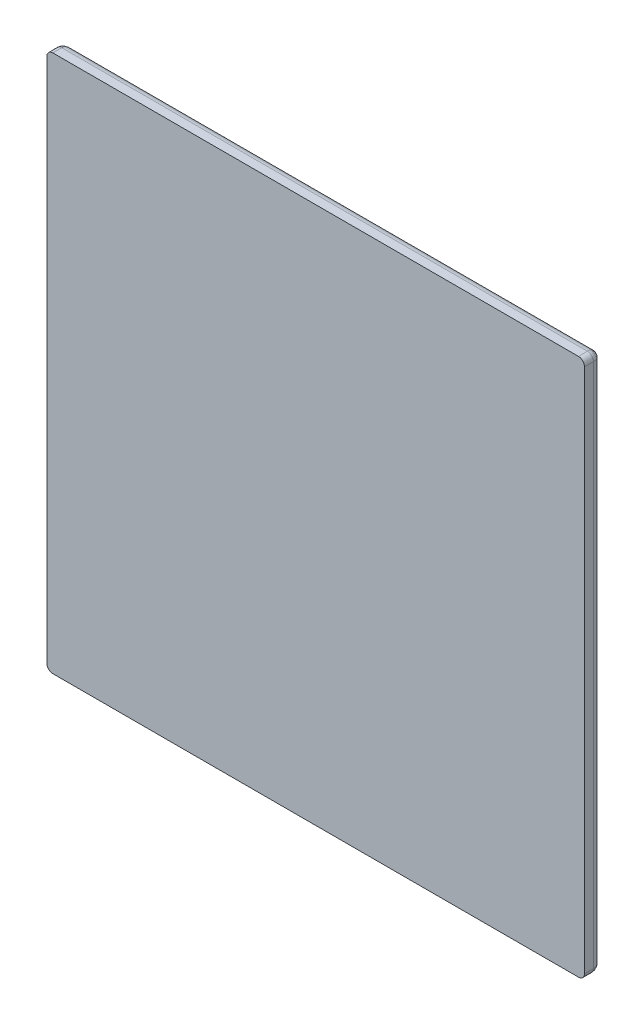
ISO-10303-21;
HEADER;
FILE_DESCRIPTION(('STEP AP214'),'2;1');
FILE_NAME('part.step','',(''),(''),'','','');
FILE_SCHEMA(('AUTOMOTIVE_DESIGN { 1 0 10303 214 1 1 1 1 }'));
ENDSEC;
DATA;
#1=APPLICATION_CONTEXT('core data for automotive mechanical design processes');
#2=APPLICATION_PROTOCOL_DEFINITION('international standard','automotive_design',2000,#1);
#3=PRODUCT_CONTEXT('',#1,'mechanical');
#4=PRODUCT('Part','Part','',(#3));
#5=PRODUCT_RELATED_PRODUCT_CATEGORY('part','',(#4));
#6=PRODUCT_DEFINITION_FORMATION('','',#4);
#7=PRODUCT_DEFINITION_CONTEXT('part definition',#1,'design');
#8=PRODUCT_DEFINITION('design','',#6,#7);
#9=PRODUCT_DEFINITION_SHAPE('','',#8);
#10=(LENGTH_UNIT() NAMED_UNIT(*) SI_UNIT(.MILLI.,.METRE.));
#11=(NAMED_UNIT(*) PLANE_ANGLE_UNIT() SI_UNIT($,.RADIAN.));
#12=(NAMED_UNIT(*) SI_UNIT($,.STERADIAN.) SOLID_ANGLE_UNIT());
#13=UNCERTAINTY_MEASURE_WITH_UNIT(LENGTH_MEASURE(1.E-05),#10,'distance_accuracy_value','');
#14=(GEOMETRIC_REPRESENTATION_CONTEXT(3) GLOBAL_UNCERTAINTY_ASSIGNED_CONTEXT((#13)) GLOBAL_UNIT_ASSIGNED_CONTEXT((#10,
#11,#12)) REPRESENTATION_CONTEXT('',''));
#15=CARTESIAN_POINT('',(0.,0.,0.));
#16=DIRECTION('',(0.,0.,1.));
#17=DIRECTION('',(1.,0.,0.));
#18=AXIS2_PLACEMENT_3D('',#15,#16,#17);
#19=CARTESIAN_POINT('',(44.,-45.,1.5));
#20=CARTESIAN_POINT('',(44.1495996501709,-45.,1.5));
#21=CARTESIAN_POINT('',(44.3738179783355,-44.9486369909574,1.5));
#22=CARTESIAN_POINT('',(44.6286992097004,-44.7883198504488,1.5));
#23=CARTESIAN_POINT('',(44.815061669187,-44.6021470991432,1.5));
#24=CARTESIAN_POINT('',(44.9618744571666,-44.3365612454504,1.5));
#25=CARTESIAN_POINT('',(45.,-44.1121997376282,1.5));
#26=CARTESIAN_POINT('',(45.,-44.,1.5));
#27=CARTESIAN_POINT('',(44.,-45.,1.38780026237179));
#28=CARTESIAN_POINT('',(44.1495996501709,-45.,1.3765841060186));
#29=CARTESIAN_POINT('',(44.3738179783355,-44.9486369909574,1.36367785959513));
#30=CARTESIAN_POINT('',(44.6286992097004,-44.7883198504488,1.35659921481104));
#31=CARTESIAN_POINT('',(44.815061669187,-44.6021470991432,1.3565890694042));
#32=CARTESIAN_POINT('',(44.9618744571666,-44.3365612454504,1.36547389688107));
#33=CARTESIAN_POINT('',(45.,-44.1121997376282,1.37940644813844));
#34=CARTESIAN_POINT('',(45.,-44.,1.38780026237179));
#35=CARTESIAN_POINT('',(43.9915290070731,-44.9745870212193,1.16354424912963));
#36=CARTESIAN_POINT('',(44.1352791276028,-44.9694358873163,1.13007528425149));
#37=CARTESIAN_POINT('',(44.3507424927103,-44.9134457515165,1.09154209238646));
#38=CARTESIAN_POINT('',(44.5975953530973,-44.7537321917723,1.07040899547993));
#39=CARTESIAN_POINT('',(44.7798730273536,-44.5716177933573,1.07037784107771));
#40=CARTESIAN_POINT('',(44.9271429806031,-44.3149302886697,1.09690476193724));
#41=CARTESIAN_POINT('',(44.9707116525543,-44.0993392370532,1.13849398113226));
#42=CARTESIAN_POINT('',(44.9745870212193,-43.9915290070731,1.16354424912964));
#43=CARTESIAN_POINT('',(43.9419195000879,-44.8257585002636,0.736975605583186));
#44=CARTESIAN_POINT('',(44.0557427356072,-44.7962162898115,0.680637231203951));
#45=CARTESIAN_POINT('',(44.2264648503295,-44.7204085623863,0.617015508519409));
#46=CARTESIAN_POINT('',(44.4308947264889,-44.5673073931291,0.582383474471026));
#47=CARTESIAN_POINT('',(44.5901157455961,-44.4081734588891,0.582345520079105));
#48=CARTESIAN_POINT('',(44.7358556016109,-44.1980442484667,0.625770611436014));
#49=CARTESIAN_POINT('',(44.8036739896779,-44.0273088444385,0.694786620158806));
#50=CARTESIAN_POINT('',(44.8257585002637,-43.9419195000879,0.736975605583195));
#51=CARTESIAN_POINT('',(43.8462795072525,-44.5388385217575,0.377495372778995));
#52=CARTESIAN_POINT('',(43.9223655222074,-44.4924880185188,0.337547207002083));
#53=CARTESIAN_POINT('',(44.036523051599,-44.4109760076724,0.293818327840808));
#54=CARTESIAN_POINT('',(44.1810914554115,-44.2838412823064,0.270305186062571));
#55=CARTESIAN_POINT('',(44.3009930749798,-44.1639660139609,0.270293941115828));
#56=CARTESIAN_POINT('',(44.4256165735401,-44.0174986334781,0.299724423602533));
#57=CARTESIAN_POINT('',(44.504138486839,-43.9033613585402,0.347551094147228));
#58=CARTESIAN_POINT('',(44.5388385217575,-43.8462795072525,0.377495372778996));
#59=CARTESIAN_POINT('',(43.6868592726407,-44.0605778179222,0.077186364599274));
#60=CARTESIAN_POINT('',(43.7226866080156,-44.0254468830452,0.066456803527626));
#61=CARTESIAN_POINT('',(43.7764620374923,-43.9725851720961,0.055005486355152));
#62=CARTESIAN_POINT('',(43.8479796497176,-43.9014686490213,0.048911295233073));
#63=CARTESIAN_POINT('',(43.9104029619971,-43.8390620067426,0.048911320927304));
#64=CARTESIAN_POINT('',(43.9814436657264,-43.7674966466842,0.056527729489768));
#65=CARTESIAN_POINT('',(44.034292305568,-43.7137463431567,0.069135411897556));
#66=CARTESIAN_POINT('',(44.0605778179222,-43.6868592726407,0.077186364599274));
#67=CARTESIAN_POINT('',(43.5747998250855,-43.7243994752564,0.));
#68=CARTESIAN_POINT('',(43.589047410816,-43.7101518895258,0.));
#69=CARTESIAN_POINT('',(43.6104187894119,-43.68878051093,0.));
#70=CARTESIAN_POINT('',(43.638913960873,-43.6602853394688,0.));
#71=CARTESIAN_POINT('',(43.6638472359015,-43.6353520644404,0.));
#72=CARTESIAN_POINT('',(43.6923424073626,-43.6068568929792,0.));
#73=CARTESIAN_POINT('',(43.7137137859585,-43.5854855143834,0.));
#74=CARTESIAN_POINT('',(43.7243994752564,-43.5747998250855,0.));
#75=CARTESIAN_POINT('',(43.5,-43.5,0.));
#76=CARTESIAN_POINT('',(43.5,-43.5,0.));
#77=CARTESIAN_POINT('',(43.5,-43.5,0.));
#78=CARTESIAN_POINT('',(43.5,-43.5,0.));
#79=CARTESIAN_POINT('',(43.5,-43.5,0.));
#80=CARTESIAN_POINT('',(43.5,-43.5,0.));
#81=CARTESIAN_POINT('',(43.5,-43.5,0.));
#82=CARTESIAN_POINT('',(43.5,-43.5,0.));
#83=B_SPLINE_SURFACE_WITH_KNOTS('',3,3,((#19,#20,#21,#22,#23,#24,#25,#26),(#27,#28,#29,#30,#31,
#32,#33,#34),(#35,#36,#37,#38,#39,#40,#41,#42),(#43,#44,#45,#46,#47,#48,#49,#50),(#51,#52,#53,
#54,#55,#56,#57,#58),(#59,#60,#61,#62,#63,#64,#65,#66),(#67,#68,#69,#70,#71,#72,#73,#74),(#75,
#76,#77,#78,#79,#80,#81,#82)),.UNSPECIFIED.,.F.,.F.,.F.,(4,1,1,1,1,4),(4,1,1,1,1,4),(0.,
0.224399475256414,0.448798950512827,0.897597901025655,1.12199737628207,1.5707963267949),(0.,
0.285714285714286,0.428571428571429,0.571428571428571,0.785714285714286,1.),.UNSPECIFIED.);
#84=CARTESIAN_POINT('',(43.5,-43.5,0.));
#85=CARTESIAN_POINT('',(43.7243994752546,-43.5747998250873,0.));
#86=CARTESIAN_POINT('',(44.0605778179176,-43.6868592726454,0.0771863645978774));
#87=CARTESIAN_POINT('',(44.5388385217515,-43.8462795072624,0.377495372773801));
#88=CARTESIAN_POINT('',(44.8257585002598,-43.9419195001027,0.736975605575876));
#89=CARTESIAN_POINT('',(44.9745870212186,-43.9915290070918,1.16354424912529));
#90=CARTESIAN_POINT('',(45.,-44.0000000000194,1.38780026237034));
#91=CARTESIAN_POINT('',(45.,-44.0000000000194,1.5));
#92=B_SPLINE_CURVE_WITH_KNOTS('',3,(#84,#85,#86,#87,#88,#89,#90,#91),.UNSPECIFIED.,.F.,.F.,(4,1,
1,1,1,4),(0.,0.448798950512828,0.673198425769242,1.12199737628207,1.34639685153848,
1.5707963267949),.UNSPECIFIED.);
#93=CARTESIAN_POINT('',(45.,-44.0000000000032,1.5));
#94=VERTEX_POINT('',#93);
#95=CARTESIAN_POINT('',(43.5,-43.5,0.));
#96=VERTEX_POINT('',#95);
#97=EDGE_CURVE('E113',#94,#96,#92,.F.);
#98=CARTESIAN_POINT('',(45.,-44.,1.5));
#99=CARTESIAN_POINT('',(45.,-44.1121997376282,1.5));
#100=CARTESIAN_POINT('',(44.9618744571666,-44.3365612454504,1.5));
#101=CARTESIAN_POINT('',(44.815061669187,-44.6021470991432,1.5));
#102=CARTESIAN_POINT('',(44.6286992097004,-44.7883198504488,1.5));
#103=CARTESIAN_POINT('',(44.3738179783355,-44.9486369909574,1.5));
#104=CARTESIAN_POINT('',(44.1495996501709,-45.,1.5));
#105=CARTESIAN_POINT('',(44.,-45.,1.5));
#106=B_SPLINE_CURVE_WITH_KNOTS('',3,(#98,#99,#100,#101,#102,#103,#104,#105),.UNSPECIFIED.,.F.,
.F.,(4,1,1,1,1,4),(0.,0.214285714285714,0.428571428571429,0.571428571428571,0.714285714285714,
1.),.UNSPECIFIED.);
#107=CARTESIAN_POINT('',(44.,-45.,1.5));
#108=VERTEX_POINT('',#107);
#109=EDGE_CURVE('E96',#94,#108,#106,.T.);
#110=CARTESIAN_POINT('',(44.,-45.,1.5));
#111=CARTESIAN_POINT('',(44.,-45.,1.38780026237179));
#112=CARTESIAN_POINT('',(43.9915290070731,-44.9745870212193,1.16354424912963));
#113=CARTESIAN_POINT('',(43.9419195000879,-44.8257585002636,0.736975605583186));
#114=CARTESIAN_POINT('',(43.8462795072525,-44.5388385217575,0.377495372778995));
#115=CARTESIAN_POINT('',(43.6868592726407,-44.0605778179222,0.077186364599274));
#116=CARTESIAN_POINT('',(43.5747998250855,-43.7243994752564,0.));
#117=CARTESIAN_POINT('',(43.5,-43.5,0.));
#118=B_SPLINE_CURVE_WITH_KNOTS('',3,(#110,#111,#112,#113,#114,#115,#116,#117),.UNSPECIFIED.,.F.,
.F.,(4,1,1,1,1,4),(0.,0.224399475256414,0.448798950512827,0.897597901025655,1.12199737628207,
1.5707963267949),.UNSPECIFIED.);
#119=EDGE_CURVE('E117',#96,#108,#118,.F.);
#120=ORIENTED_EDGE('',*,*,#97,.F.);
#121=ORIENTED_EDGE('',*,*,#109,.T.);
#122=ORIENTED_EDGE('',*,*,#119,.F.);
#123=EDGE_LOOP('',(#120,#121,#122));
#124=FACE_BOUND('',#123,.T.);
#125=ADVANCED_FACE('F16',(#124),#83,.T.);
#126=CARTESIAN_POINT('',(45.,44.,1.5));
#127=CARTESIAN_POINT('',(45.,44.1495996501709,1.5));
#128=CARTESIAN_POINT('',(44.9486369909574,44.3738179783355,1.5));
#129=CARTESIAN_POINT('',(44.7883198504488,44.6286992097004,1.5));
#130=CARTESIAN_POINT('',(44.6021470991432,44.8150616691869,1.5));
#131=CARTESIAN_POINT('',(44.3365612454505,44.9618744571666,1.5));
#132=CARTESIAN_POINT('',(44.1121997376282,45.,1.5));
#133=CARTESIAN_POINT('',(44.,45.,1.5));
#134=CARTESIAN_POINT('',(45.,44.,1.38780026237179));
#135=CARTESIAN_POINT('',(45.,44.1495996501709,1.3765841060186));
#136=CARTESIAN_POINT('',(44.9486369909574,44.3738179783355,1.36367785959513));
#137=CARTESIAN_POINT('',(44.7883198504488,44.6286992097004,1.35659921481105));
#138=CARTESIAN_POINT('',(44.6021470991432,44.8150616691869,1.3565890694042));
#139=CARTESIAN_POINT('',(44.3365612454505,44.9618744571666,1.36547389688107));
#140=CARTESIAN_POINT('',(44.1121997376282,45.,1.37940644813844));
#141=CARTESIAN_POINT('',(44.,45.,1.38780026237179));
#142=CARTESIAN_POINT('',(44.9745870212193,43.9915290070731,1.16354424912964));
#143=CARTESIAN_POINT('',(44.9694358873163,44.1352791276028,1.1300752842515));
#144=CARTESIAN_POINT('',(44.9134457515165,44.3507424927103,1.09154209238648));
#145=CARTESIAN_POINT('',(44.7537321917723,44.5975953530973,1.07040899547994));
#146=CARTESIAN_POINT('',(44.5716177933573,44.7798730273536,1.07037784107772));
#147=CARTESIAN_POINT('',(44.3149302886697,44.9271429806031,1.09690476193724));
#148=CARTESIAN_POINT('',(44.0993392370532,44.9707116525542,1.13849398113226));
#149=CARTESIAN_POINT('',(43.9915290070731,44.9745870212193,1.16354424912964));
#150=CARTESIAN_POINT('',(44.8257585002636,43.9419195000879,0.736975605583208));
#151=CARTESIAN_POINT('',(44.7962162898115,44.0557427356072,0.680637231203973));
#152=CARTESIAN_POINT('',(44.7204085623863,44.2264648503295,0.617015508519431));
#153=CARTESIAN_POINT('',(44.5673073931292,44.4308947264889,0.582383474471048));
#154=CARTESIAN_POINT('',(44.4081734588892,44.5901157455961,0.582345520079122));
#155=CARTESIAN_POINT('',(44.1980442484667,44.7358556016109,0.625770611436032));
#156=CARTESIAN_POINT('',(44.0273088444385,44.8036739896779,0.694786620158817));
#157=CARTESIAN_POINT('',(43.9419195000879,44.8257585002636,0.736975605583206));
#158=CARTESIAN_POINT('',(44.5388385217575,43.8462795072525,0.377495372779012));
#159=CARTESIAN_POINT('',(44.4924880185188,43.9223655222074,0.337547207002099));
#160=CARTESIAN_POINT('',(44.4109760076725,44.036523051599,0.293818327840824));
#161=CARTESIAN_POINT('',(44.2838412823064,44.1810914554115,0.270305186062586));
#162=CARTESIAN_POINT('',(44.163966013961,44.3009930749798,0.270293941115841));
#163=CARTESIAN_POINT('',(44.0174986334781,44.4256165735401,0.299724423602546));
#164=CARTESIAN_POINT('',(43.9033613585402,44.504138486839,0.347551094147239));
#165=CARTESIAN_POINT('',(43.8462795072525,44.5388385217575,0.377495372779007));
#166=CARTESIAN_POINT('',(44.0605778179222,43.6868592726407,0.077186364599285));
#167=CARTESIAN_POINT('',(44.0254468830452,43.7226866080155,0.066456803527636));
#168=CARTESIAN_POINT('',(43.9725851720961,43.7764620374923,0.055005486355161));
#169=CARTESIAN_POINT('',(43.9014686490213,43.8479796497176,0.048911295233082));
#170=CARTESIAN_POINT('',(43.8390620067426,43.9104029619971,0.048911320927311));
#171=CARTESIAN_POINT('',(43.7674966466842,43.9814436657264,0.056527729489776));
#172=CARTESIAN_POINT('',(43.7137463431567,44.034292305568,0.069135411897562));
#173=CARTESIAN_POINT('',(43.6868592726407,44.0605778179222,0.077186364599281));
#174=CARTESIAN_POINT('',(43.7243994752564,43.5747998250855,0.));
#175=CARTESIAN_POINT('',(43.7101518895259,43.589047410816,0.));
#176=CARTESIAN_POINT('',(43.68878051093,43.6104187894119,0.));
#177=CARTESIAN_POINT('',(43.6602853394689,43.638913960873,0.));
#178=CARTESIAN_POINT('',(43.6353520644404,43.6638472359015,0.));
#179=CARTESIAN_POINT('',(43.6068568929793,43.6923424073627,0.));
#180=CARTESIAN_POINT('',(43.5854855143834,43.7137137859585,0.));
#181=CARTESIAN_POINT('',(43.5747998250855,43.7243994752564,0.));
#182=CARTESIAN_POINT('',(43.5,43.5,0.));
#183=CARTESIAN_POINT('',(43.5,43.5,0.));
#184=CARTESIAN_POINT('',(43.5,43.5,0.));
#185=CARTESIAN_POINT('',(43.5,43.5,0.));
#186=CARTESIAN_POINT('',(43.5,43.5,0.));
#187=CARTESIAN_POINT('',(43.5,43.5,0.));
#188=CARTESIAN_POINT('',(43.5,43.5,0.));
#189=CARTESIAN_POINT('',(43.5,43.5,0.));
#190=B_SPLINE_SURFACE_WITH_KNOTS('',3,3,((#126,#127,#128,#129,#130,#131,#132,#133),(#134,#135,
#136,#137,#138,#139,#140,#141),(#142,#143,#144,#145,#146,#147,#148,#149),(#150,#151,#152,#153,
#154,#155,#156,#157),(#158,#159,#160,#161,#162,#163,#164,#165),(#166,#167,#168,#169,#170,#171,
#172,#173),(#174,#175,#176,#177,#178,#179,#180,#181),(#182,#183,#184,#185,#186,#187,#188,#189)),
.UNSPECIFIED.,.F.,.F.,.F.,(4,1,1,1,1,4),(4,1,1,1,1,4),(0.,0.224399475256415,0.448798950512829,
0.897597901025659,1.12199737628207,1.5707963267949),(0.,0.285714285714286,0.428571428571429,
0.571428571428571,0.785714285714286,1.),.UNSPECIFIED.);
#191=CARTESIAN_POINT('',(43.5,43.5,0.));
#192=CARTESIAN_POINT('',(43.574799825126,43.7243994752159,0.));
#193=CARTESIAN_POINT('',(43.6868592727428,44.0605778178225,0.0771863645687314));
#194=CARTESIAN_POINT('',(43.8462795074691,44.5388385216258,0.377495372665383));
#195=CARTESIAN_POINT('',(43.9419195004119,44.8257585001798,0.736975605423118));
#196=CARTESIAN_POINT('',(43.9915290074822,44.9745870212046,1.16354424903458));
#197=CARTESIAN_POINT('',(44.0000000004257,45.,1.38780026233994));
#198=CARTESIAN_POINT('',(44.0000000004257,45.,1.5));
#199=B_SPLINE_CURVE_WITH_KNOTS('',3,(#191,#192,#193,#194,#195,#196,#197,#198),.UNSPECIFIED.,.F.,
.F.,(4,1,1,1,1,4),(0.,0.448798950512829,0.673198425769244,1.12199737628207,1.34639685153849,
1.5707963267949),.UNSPECIFIED.);
#200=CARTESIAN_POINT('',(44.0000000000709,45.,1.5));
#201=VERTEX_POINT('',#200);
#202=CARTESIAN_POINT('',(43.5,43.5,0.));
#203=VERTEX_POINT('',#202);
#204=EDGE_CURVE('E232',#201,#203,#199,.F.);
#205=CARTESIAN_POINT('',(44.,45.,1.5));
#206=CARTESIAN_POINT('',(44.0130898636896,45.0000000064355,1.5));
#207=CARTESIAN_POINT('',(44.0261796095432,44.99974053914,1.5));
#208=CARTESIAN_POINT('',(44.0523386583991,44.9987060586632,1.5));
#209=CARTESIAN_POINT('',(44.0654079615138,44.9979310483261,1.5));
#210=CARTESIAN_POINT('',(44.0915061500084,44.9958688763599,1.5));
#211=CARTESIAN_POINT('',(44.1045350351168,44.9945817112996,1.5));
#212=CARTESIAN_POINT('',(44.1305324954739,44.9914986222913,1.5));
#213=CARTESIAN_POINT('',(44.1435010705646,44.9897026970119,1.5));
#214=CARTESIAN_POINT('',(44.1693579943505,44.9856054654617,1.5));
#215=CARTESIAN_POINT('',(44.1822463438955,44.9833041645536,1.5));
#216=CARTESIAN_POINT('',(44.2079229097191,44.9781995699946,1.5));
#217=CARTESIAN_POINT('',(44.2207111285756,44.9753962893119,1.5));
#218=CARTESIAN_POINT('',(44.2461675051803,44.9692910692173,1.5));
#219=CARTESIAN_POINT('',(44.2588356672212,44.9659891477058,1.5));
#220=CARTESIAN_POINT('',(44.2840320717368,44.9588901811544,1.5));
#221=CARTESIAN_POINT('',(44.2965603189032,44.9550931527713,1.5));
#222=CARTESIAN_POINT('',(44.3214567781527,44.9470067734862,1.5));
#223=CARTESIAN_POINT('',(44.3338249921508,44.9427174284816,1.5));
#224=CARTESIAN_POINT('',(44.3583822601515,44.933652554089,1.5));
#225=CARTESIAN_POINT('',(44.3705713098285,44.9288770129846,1.5));
#226=CARTESIAN_POINT('',(44.394752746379,44.9188503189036,1.5));
#227=CARTESIAN_POINT('',(44.4067451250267,44.913599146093,1.5));
#228=CARTESIAN_POINT('',(44.4305154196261,44.9026308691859,1.5));
#229=CARTESIAN_POINT('',(44.4422933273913,44.8969137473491,1.5));
#230=CARTESIAN_POINT('',(44.4656169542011,44.8850234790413,1.5));
#231=CARTESIAN_POINT('',(44.4771626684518,44.8788503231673,1.5));
#232=CARTESIAN_POINT('',(44.500004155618,44.8660578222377,1.5));
#233=CARTESIAN_POINT('',(44.5112999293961,44.8594384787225,1.5));
#234=CARTESIAN_POINT('',(44.5336237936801,44.8457634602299,1.5));
#235=CARTESIAN_POINT('',(44.5446518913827,44.8387077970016,1.5));
#236=CARTESIAN_POINT('',(44.56642263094,44.8241699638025,1.5));
#237=CARTESIAN_POINT('',(44.5771652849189,44.8166878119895,1.5));
#238=CARTESIAN_POINT('',(44.5983474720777,44.8013069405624,1.5));
#239=CARTESIAN_POINT('',(44.6087870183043,44.7934082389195,1.5));
#240=CARTESIAN_POINT('',(44.6293449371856,44.777203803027,1.5));
#241=CARTESIAN_POINT('',(44.639463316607,44.7688980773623,1.5));
#242=CARTESIAN_POINT('',(44.6593647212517,44.7518939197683,1.5));
#243=CARTESIAN_POINT('',(44.669147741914,44.7431954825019,1.5));
#244=CARTESIAN_POINT('',(44.6883649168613,44.7254208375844,1.5));
#245=CARTESIAN_POINT('',(44.6977990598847,44.7163446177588,1.5));
#246=CARTESIAN_POINT('',(44.7163047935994,44.6978291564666,1.5));
#247=CARTESIAN_POINT('',(44.7253763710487,44.6883899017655,1.5));
#248=CARTESIAN_POINT('',(44.7431433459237,44.6691631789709,1.5));
#249=CARTESIAN_POINT('',(44.7518387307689,44.6593756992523,1.5));
#250=CARTESIAN_POINT('',(44.7688396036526,44.63946725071,1.5));
#251=CARTESIAN_POINT('',(44.7771450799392,44.6293462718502,1.5));
#252=CARTESIAN_POINT('',(44.7933526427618,44.6087858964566,1.5));
#253=CARTESIAN_POINT('',(44.8012547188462,44.5983464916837,1.5));
#254=CARTESIAN_POINT('',(44.8166438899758,44.5771661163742,1.5));
#255=CARTESIAN_POINT('',(44.8241309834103,44.5664251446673,1.5));
#256=CARTESIAN_POINT('',(44.8386784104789,44.5446583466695,1.5));
#257=CARTESIAN_POINT('',(44.8457387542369,44.5336325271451,1.5));
#258=CARTESIAN_POINT('',(44.8594208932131,44.5113127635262,1.5));
#259=CARTESIAN_POINT('',(44.8660427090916,44.5000188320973,1.5));
#260=CARTESIAN_POINT('',(44.8788361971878,44.4771796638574,1.5));
#261=CARTESIAN_POINT('',(44.8850078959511,44.4656344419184,1.5));
#262=CARTESIAN_POINT('',(44.8968888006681,44.4423091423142,1.5));
#263=CARTESIAN_POINT('',(44.9025980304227,44.4305290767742,1.5));
#264=CARTESIAN_POINT('',(44.9135450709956,44.4067521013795,1.5));
#265=CARTESIAN_POINT('',(44.9187828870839,44.3947551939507,1.5));
#266=CARTESIAN_POINT('',(44.9287829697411,44.3705644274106,1.5));
#267=CARTESIAN_POINT('',(44.933545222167,44.3583705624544,1.5));
#268=CARTESIAN_POINT('',(44.9425891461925,44.3338053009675,1.5));
#269=CARTESIAN_POINT('',(44.9468707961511,44.3214338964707,1.5));
#270=CARTESIAN_POINT('',(44.954948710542,44.2965330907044,1.5));
#271=CARTESIAN_POINT('',(44.9587449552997,44.2840036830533,1.5));
#272=CARTESIAN_POINT('',(44.9658471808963,44.2588063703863,1.5));
#273=CARTESIAN_POINT('',(44.9691531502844,44.2461384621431,1.5));
#274=CARTESIAN_POINT('',(44.9752699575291,44.2206836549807,1.5));
#275=CARTESIAN_POINT('',(44.9780807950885,44.2078967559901,1.5));
#276=CARTESIAN_POINT('',(44.9832024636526,44.1822234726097,1.5));
#277=CARTESIAN_POINT('',(44.985513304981,44.1693370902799,1.5));
#278=CARTESIAN_POINT('',(44.9896301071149,44.1434843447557,1.5));
#279=CARTESIAN_POINT('',(44.9914360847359,44.13051798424,1.5));
#280=CARTESIAN_POINT('',(44.9945382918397,44.1045247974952,1.5));
#281=CARTESIAN_POINT('',(44.9958345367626,44.0914979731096,1.5));
#282=CARTESIAN_POINT('',(44.9979124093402,44.0654033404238,1.5));
#283=CARTESIAN_POINT('',(44.9986940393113,44.0523355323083,1.5));
#284=CARTESIAN_POINT('',(44.9997378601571,44.0261785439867,1.5));
#285=CARTESIAN_POINT('',(45.0000000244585,44.0130893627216,1.5));
#286=CARTESIAN_POINT('',(45.,44.,1.5));
#287=B_SPLINE_CURVE_WITH_KNOTS('',3,(#205,#206,#207,#208,#209,#210,#211,#212,#213,#214,#215,
#216,#217,#218,#219,#220,#221,#222,#223,#224,#225,#226,#227,#228,#229,#230,#231,#232,#233,#234,
#235,#236,#237,#238,#239,#240,#241,#242,#243,#244,#245,#246,#247,#248,#249,#250,#251,#252,#253,
#254,#255,#256,#257,#258,#259,#260,#261,#262,#263,#264,#265,#266,#267,#268,#269,#270,#271,#272,
#273,#274,#275,#276,#277,#278,#279,#280,#281,#282,#283,#284,#285,#286),.UNSPECIFIED.,.F.,.F.,(4,
2,2,2,2,2,2,2,2,2,2,2,2,2,2,2,2,2,2,2,2,2,2,2,2,2,2,2,2,2,2,2,2,2,2,2,2,2,2,2,4),(0.,
0.0392668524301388,0.0785334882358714,0.117800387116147,0.157067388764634,0.196333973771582,
0.235599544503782,0.274863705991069,0.314126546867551,0.353388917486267,0.392652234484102,
0.431917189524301,0.471183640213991,0.510450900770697,0.549718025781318,0.588984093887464,
0.628248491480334,0.667511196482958,0.706773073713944,0.746035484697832,0.785299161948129,
0.824564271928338,0.863830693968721,0.903098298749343,0.942366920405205,0.98163569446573,
1.02090353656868,1.06016952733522,1.09943320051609,1.13869485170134,1.17795606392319,
1.21721844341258,1.25648259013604,1.29574832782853,1.33501498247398,1.37428166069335,
1.4135475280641,1.45281208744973,1.49207545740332,1.53133865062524,1.57060385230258),.UNSPECIFIED.);
#288=CARTESIAN_POINT('',(45.,44.,1.5));
#289=VERTEX_POINT('',#288);
#290=EDGE_CURVE('E109',#201,#289,#287,.T.);
#291=CARTESIAN_POINT('',(45.,44.,1.5));
#292=CARTESIAN_POINT('',(45.,44.,1.38780026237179));
#293=CARTESIAN_POINT('',(44.9745870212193,43.9915290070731,1.16354424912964));
#294=CARTESIAN_POINT('',(44.8257585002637,43.9419195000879,0.736975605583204));
#295=CARTESIAN_POINT('',(44.5388385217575,43.8462795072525,0.377495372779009));
#296=CARTESIAN_POINT('',(44.0605778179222,43.6868592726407,0.0771863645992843));
#297=CARTESIAN_POINT('',(43.7243994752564,43.5747998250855,0.));
#298=CARTESIAN_POINT('',(43.5,43.5,0.));
#299=B_SPLINE_CURVE_WITH_KNOTS('',3,(#291,#292,#293,#294,#295,#296,#297,#298),.UNSPECIFIED.,.F.,
.F.,(4,1,1,1,1,4),(0.,0.224399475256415,0.448798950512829,0.897597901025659,1.12199737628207,
1.5707963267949),.UNSPECIFIED.);
#300=EDGE_CURVE('E124',#203,#289,#299,.F.);
#301=ORIENTED_EDGE('',*,*,#204,.F.);
#302=ORIENTED_EDGE('',*,*,#290,.T.);
#303=ORIENTED_EDGE('',*,*,#300,.F.);
#304=EDGE_LOOP('',(#301,#302,#303));
#305=FACE_BOUND('',#304,.T.);
#306=ADVANCED_FACE('F332',(#305),#190,.T.);
#307=CARTESIAN_POINT('',(-44.,45.,1.5));
#308=CARTESIAN_POINT('',(-44.149599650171,45.,1.5));
#309=CARTESIAN_POINT('',(-44.3738179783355,44.9486369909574,1.5));
#310=CARTESIAN_POINT('',(-44.6286992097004,44.7883198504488,1.5));
#311=CARTESIAN_POINT('',(-44.815061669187,44.6021470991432,1.5));
#312=CARTESIAN_POINT('',(-44.9618744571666,44.3365612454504,1.5));
#313=CARTESIAN_POINT('',(-45.,44.1121997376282,1.5));
#314=CARTESIAN_POINT('',(-45.,44.,1.5));
#315=CARTESIAN_POINT('',(-44.,45.,1.38780026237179));
#316=CARTESIAN_POINT('',(-44.149599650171,45.,1.3765841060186));
#317=CARTESIAN_POINT('',(-44.3738179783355,44.9486369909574,1.36367785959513));
#318=CARTESIAN_POINT('',(-44.6286992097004,44.7883198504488,1.35659921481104));
#319=CARTESIAN_POINT('',(-44.815061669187,44.6021470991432,1.3565890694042));
#320=CARTESIAN_POINT('',(-44.9618744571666,44.3365612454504,1.36547389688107));
#321=CARTESIAN_POINT('',(-45.,44.1121997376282,1.37940644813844));
#322=CARTESIAN_POINT('',(-45.,44.,1.38780026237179));
#323=CARTESIAN_POINT('',(-43.99158744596,44.97476233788,1.16338475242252));
#324=CARTESIAN_POINT('',(-44.1351532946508,44.9692850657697,1.12989829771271));
#325=CARTESIAN_POINT('',(-44.3503398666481,44.9129472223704,1.0913999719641));
#326=CARTESIAN_POINT('',(-44.5969903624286,44.7530926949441,1.07029855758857));
#327=CARTESIAN_POINT('',(-44.7792263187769,44.571018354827,1.07026789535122));
#328=CARTESIAN_POINT('',(-44.9266870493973,44.3145733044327,1.09675315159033));
#329=CARTESIAN_POINT('',(-44.9706403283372,44.0992588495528,1.13831965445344));
#330=CARTESIAN_POINT('',(-44.97476233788,43.99158744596,1.16338475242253));
#331=CARTESIAN_POINT('',(-43.9542724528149,44.8628173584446,0.843754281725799));
#332=CARTESIAN_POINT('',(-44.0757412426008,44.8396581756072,0.79317059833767));
#333=CARTESIAN_POINT('',(-44.2578925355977,44.7691042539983,0.73581698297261));
#334=CARTESIAN_POINT('',(-44.4731048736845,44.6144778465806,0.704548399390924));
#335=CARTESIAN_POINT('',(-44.6381244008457,44.4495649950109,0.704511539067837));
#336=CARTESIAN_POINT('',(-44.7840758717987,44.2275840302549,0.743728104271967));
#337=CARTESIAN_POINT('',(-44.8454972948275,44.0453894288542,0.805878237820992));
#338=CARTESIAN_POINT('',(-44.8628173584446,43.9542724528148,0.843754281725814));
#339=CARTESIAN_POINT('',(-43.8742565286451,44.6227695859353,0.461142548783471));
#340=CARTESIAN_POINT('',(-43.9596864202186,44.578664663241,0.41371384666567));
#341=CARTESIAN_POINT('',(-44.0878690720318,44.4960491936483,0.361350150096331));
#342=CARTESIAN_POINT('',(-44.2480507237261,44.360236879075,0.333100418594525));
#343=CARTESIAN_POINT('',(-44.3789740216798,44.2293531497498,0.333081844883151));
#344=CARTESIAN_POINT('',(-44.51127532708,44.0665092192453,0.36845890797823));
#345=CARTESIAN_POINT('',(-44.5897773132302,43.9383532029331,0.425599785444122));
#346=CARTESIAN_POINT('',(-44.6227695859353,43.8742565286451,0.461142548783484));
#347=CARTESIAN_POINT('',(-43.724383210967,44.173149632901,0.102460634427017));
#348=CARTESIAN_POINT('',(-43.7669260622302,44.1301594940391,0.088220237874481));
#349=CARTESIAN_POINT('',(-43.8307795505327,44.0658620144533,0.073204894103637));
#350=CARTESIAN_POINT('',(-43.9160957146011,43.9801877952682,0.065253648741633));
#351=CARTESIAN_POINT('',(-43.9908895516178,43.9054100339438,0.065255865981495));
#352=CARTESIAN_POINT('',(-44.0765951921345,43.8201331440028,0.075185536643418));
#353=CARTESIAN_POINT('',(-44.1409764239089,43.7563084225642,0.091772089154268));
#354=CARTESIAN_POINT('',(-44.1731496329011,43.724383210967,0.102460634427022));
#355=CARTESIAN_POINT('',(-43.5747998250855,43.7243994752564,0.));
#356=CARTESIAN_POINT('',(-43.5890474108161,43.7101518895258,0.));
#357=CARTESIAN_POINT('',(-43.6104187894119,43.6887805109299,0.));
#358=CARTESIAN_POINT('',(-43.638913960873,43.6602853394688,0.));
#359=CARTESIAN_POINT('',(-43.6638472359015,43.6353520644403,0.));
#360=CARTESIAN_POINT('',(-43.6923424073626,43.6068568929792,0.));
#361=CARTESIAN_POINT('',(-43.7137137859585,43.5854855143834,0.));
#362=CARTESIAN_POINT('',(-43.7243994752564,43.5747998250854,0.));
#363=CARTESIAN_POINT('',(-43.5,43.5,0.));
#364=CARTESIAN_POINT('',(-43.5,43.5,0.));
#365=CARTESIAN_POINT('',(-43.5,43.4999999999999,0.));
#366=CARTESIAN_POINT('',(-43.5,43.5,0.));
#367=CARTESIAN_POINT('',(-43.5,43.4999999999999,0.));
#368=CARTESIAN_POINT('',(-43.5,43.5,0.));
#369=CARTESIAN_POINT('',(-43.5,43.5,0.));
#370=CARTESIAN_POINT('',(-43.5,43.5,0.));
#371=B_SPLINE_SURFACE_WITH_KNOTS('',3,3,((#307,#308,#309,#310,#311,#312,#313,#314),(#315,#316,
#317,#318,#319,#320,#321,#322),(#323,#324,#325,#326,#327,#328,#329,#330),(#331,#332,#333,#334,
#335,#336,#337,#338),(#339,#340,#341,#342,#343,#344,#345,#346),(#347,#348,#349,#350,#351,#352,
#353,#354),(#355,#356,#357,#358,#359,#360,#361,#362),(#363,#364,#365,#366,#367,#368,#369,#370)),
.UNSPECIFIED.,.F.,.F.,.F.,(4,1,1,1,1,4),(4,1,1,1,1,4),(0.,0.224399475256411,0.448798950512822,
0.673198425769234,1.12199737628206,1.57079632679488),(0.,0.285714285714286,0.428571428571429,
0.571428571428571,0.785714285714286,1.),.UNSPECIFIED.);
#372=CARTESIAN_POINT('',(-43.5,43.5,0.));
#373=CARTESIAN_POINT('',(-43.7243994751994,43.5747998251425,0.));
#374=CARTESIAN_POINT('',(-44.1731496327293,43.7243832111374,0.102460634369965));
#375=CARTESIAN_POINT('',(-44.6227695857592,43.8742565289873,0.461142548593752));
#376=CARTESIAN_POINT('',(-44.8628173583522,43.9542724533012,0.843754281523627));
#377=CARTESIAN_POINT('',(-44.974762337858,43.9915874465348,1.16338475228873));
#378=CARTESIAN_POINT('',(-45.,44.0000000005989,1.38780026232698));
#379=CARTESIAN_POINT('',(-45.,44.0000000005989,1.5));
#380=B_SPLINE_CURVE_WITH_KNOTS('',3,(#372,#373,#374,#375,#376,#377,#378,#379),.UNSPECIFIED.,.F.,
.F.,(4,1,1,1,1,4),(0.,0.448798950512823,0.897597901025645,1.12199737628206,1.34639685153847,
1.57079632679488),.UNSPECIFIED.);
#381=CARTESIAN_POINT('',(-45.,44.0000000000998,1.5));
#382=VERTEX_POINT('',#381);
#383=CARTESIAN_POINT('',(-43.5,43.5,0.));
#384=VERTEX_POINT('',#383);
#385=EDGE_CURVE('E171',#382,#384,#380,.F.);
#386=CARTESIAN_POINT('',(-45.,44.,1.5));
#387=CARTESIAN_POINT('',(-45.0000000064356,44.0130898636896,1.5));
#388=CARTESIAN_POINT('',(-44.99974053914,44.0261796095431,1.5));
#389=CARTESIAN_POINT('',(-44.9987060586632,44.052338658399,1.5));
#390=CARTESIAN_POINT('',(-44.9979310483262,44.0654079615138,1.5));
#391=CARTESIAN_POINT('',(-44.99586887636,44.0915061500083,1.5));
#392=CARTESIAN_POINT('',(-44.9945817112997,44.1045350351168,1.5));
#393=CARTESIAN_POINT('',(-44.9914986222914,44.1305324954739,1.5));
#394=CARTESIAN_POINT('',(-44.9897026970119,44.1435010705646,1.5));
#395=CARTESIAN_POINT('',(-44.9856054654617,44.1693579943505,1.5));
#396=CARTESIAN_POINT('',(-44.9833041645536,44.1822463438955,1.5));
#397=CARTESIAN_POINT('',(-44.9781995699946,44.2079229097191,1.5));
#398=CARTESIAN_POINT('',(-44.9753962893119,44.2207111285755,1.5));
#399=CARTESIAN_POINT('',(-44.9692910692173,44.2461675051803,1.5));
#400=CARTESIAN_POINT('',(-44.9659891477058,44.2588356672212,1.5));
#401=CARTESIAN_POINT('',(-44.9588901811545,44.2840320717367,1.5));
#402=CARTESIAN_POINT('',(-44.9550931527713,44.2965603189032,1.5));
#403=CARTESIAN_POINT('',(-44.9470067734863,44.3214567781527,1.5));
#404=CARTESIAN_POINT('',(-44.9427174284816,44.3338249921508,1.5));
#405=CARTESIAN_POINT('',(-44.9336525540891,44.3583822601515,1.5));
#406=CARTESIAN_POINT('',(-44.9288770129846,44.3705713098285,1.5));
#407=CARTESIAN_POINT('',(-44.9188503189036,44.394752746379,1.5));
#408=CARTESIAN_POINT('',(-44.913599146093,44.4067451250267,1.5));
#409=CARTESIAN_POINT('',(-44.9026308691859,44.4305154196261,1.5));
#410=CARTESIAN_POINT('',(-44.8969137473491,44.4422933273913,1.5));
#411=CARTESIAN_POINT('',(-44.8850234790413,44.4656169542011,1.5));
#412=CARTESIAN_POINT('',(-44.8788503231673,44.4771626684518,1.5));
#413=CARTESIAN_POINT('',(-44.8660578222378,44.5000041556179,1.5));
#414=CARTESIAN_POINT('',(-44.8594384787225,44.5112999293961,1.5));
#415=CARTESIAN_POINT('',(-44.8457634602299,44.5336237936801,1.5));
#416=CARTESIAN_POINT('',(-44.8387077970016,44.5446518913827,1.5));
#417=CARTESIAN_POINT('',(-44.8241699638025,44.56642263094,1.5));
#418=CARTESIAN_POINT('',(-44.8166878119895,44.5771652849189,1.5));
#419=CARTESIAN_POINT('',(-44.8013069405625,44.5983474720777,1.5));
#420=CARTESIAN_POINT('',(-44.7934082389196,44.6087870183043,1.5));
#421=CARTESIAN_POINT('',(-44.777203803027,44.6293449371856,1.5));
#422=CARTESIAN_POINT('',(-44.7688980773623,44.639463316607,1.5));
#423=CARTESIAN_POINT('',(-44.7518939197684,44.6593647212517,1.5));
#424=CARTESIAN_POINT('',(-44.7431954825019,44.669147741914,1.5));
#425=CARTESIAN_POINT('',(-44.7254208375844,44.6883649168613,1.5));
#426=CARTESIAN_POINT('',(-44.7163446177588,44.6977990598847,1.5));
#427=CARTESIAN_POINT('',(-44.6978291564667,44.7163047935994,1.5));
#428=CARTESIAN_POINT('',(-44.6883899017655,44.7253763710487,1.5));
#429=CARTESIAN_POINT('',(-44.6691631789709,44.7431433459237,1.5));
#430=CARTESIAN_POINT('',(-44.6593756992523,44.7518387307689,1.5));
#431=CARTESIAN_POINT('',(-44.6394672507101,44.7688396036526,1.5));
#432=CARTESIAN_POINT('',(-44.6293462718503,44.7771450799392,1.5));
#433=CARTESIAN_POINT('',(-44.6087858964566,44.7933526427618,1.5));
#434=CARTESIAN_POINT('',(-44.5983464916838,44.8012547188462,1.5));
#435=CARTESIAN_POINT('',(-44.5771661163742,44.8166438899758,1.5));
#436=CARTESIAN_POINT('',(-44.5664251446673,44.8241309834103,1.5));
#437=CARTESIAN_POINT('',(-44.5446583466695,44.8386784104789,1.5));
#438=CARTESIAN_POINT('',(-44.5336325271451,44.8457387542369,1.5));
#439=CARTESIAN_POINT('',(-44.5113127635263,44.8594208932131,1.5));
#440=CARTESIAN_POINT('',(-44.5000188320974,44.8660427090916,1.5));
#441=CARTESIAN_POINT('',(-44.4771796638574,44.8788361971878,1.5));
#442=CARTESIAN_POINT('',(-44.4656344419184,44.8850078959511,1.5));
#443=CARTESIAN_POINT('',(-44.4423091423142,44.8968888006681,1.5));
#444=CARTESIAN_POINT('',(-44.4305290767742,44.9025980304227,1.5));
#445=CARTESIAN_POINT('',(-44.4067521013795,44.9135450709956,1.5));
#446=CARTESIAN_POINT('',(-44.3947551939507,44.9187828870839,1.5));
#447=CARTESIAN_POINT('',(-44.3705644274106,44.9287829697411,1.5));
#448=CARTESIAN_POINT('',(-44.3583705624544,44.933545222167,1.5));
#449=CARTESIAN_POINT('',(-44.3338053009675,44.9425891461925,1.5));
#450=CARTESIAN_POINT('',(-44.3214338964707,44.9468707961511,1.5));
#451=CARTESIAN_POINT('',(-44.2965330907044,44.954948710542,1.5));
#452=CARTESIAN_POINT('',(-44.2840036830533,44.9587449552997,1.5));
#453=CARTESIAN_POINT('',(-44.2588063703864,44.9658471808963,1.5));
#454=CARTESIAN_POINT('',(-44.2461384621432,44.9691531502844,1.5));
#455=CARTESIAN_POINT('',(-44.2206836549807,44.9752699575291,1.5));
#456=CARTESIAN_POINT('',(-44.2078967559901,44.9780807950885,1.5));
#457=CARTESIAN_POINT('',(-44.1822234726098,44.9832024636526,1.5));
#458=CARTESIAN_POINT('',(-44.1693370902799,44.985513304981,1.5));
#459=CARTESIAN_POINT('',(-44.1434843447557,44.9896301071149,1.5));
#460=CARTESIAN_POINT('',(-44.13051798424,44.9914360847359,1.5));
#461=CARTESIAN_POINT('',(-44.1045247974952,44.9945382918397,1.5));
#462=CARTESIAN_POINT('',(-44.0914979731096,44.9958345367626,1.5));
#463=CARTESIAN_POINT('',(-44.0654033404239,44.9979124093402,1.5));
#464=CARTESIAN_POINT('',(-44.0523355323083,44.9986940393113,1.5));
#465=CARTESIAN_POINT('',(-44.0261785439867,44.9997378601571,1.5));
#466=CARTESIAN_POINT('',(-44.0130893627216,45.0000000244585,1.5));
#467=CARTESIAN_POINT('',(-44.,45.,1.5));
#468=B_SPLINE_CURVE_WITH_KNOTS('',3,(#386,#387,#388,#389,#390,#391,#392,#393,#394,#395,#396,
#397,#398,#399,#400,#401,#402,#403,#404,#405,#406,#407,#408,#409,#410,#411,#412,#413,#414,#415,
#416,#417,#418,#419,#420,#421,#422,#423,#424,#425,#426,#427,#428,#429,#430,#431,#432,#433,#434,
#435,#436,#437,#438,#439,#440,#441,#442,#443,#444,#445,#446,#447,#448,#449,#450,#451,#452,#453,
#454,#455,#456,#457,#458,#459,#460,#461,#462,#463,#464,#465,#466,#467),.UNSPECIFIED.,.F.,.F.,(4,
2,2,2,2,2,2,2,2,2,2,2,2,2,2,2,2,2,2,2,2,2,2,2,2,2,2,2,2,2,2,2,2,2,2,2,2,2,2,2,4),(0.,
0.0392668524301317,0.0785334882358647,0.11780038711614,0.157067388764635,0.196333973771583,
0.235599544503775,0.274863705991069,0.314126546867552,0.353388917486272,0.3926522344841,
0.431917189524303,0.471183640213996,0.51045090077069,0.549718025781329,0.588984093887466,
0.628248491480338,0.667511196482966,0.706773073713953,0.746035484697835,0.785299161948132,
0.824564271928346,0.86383069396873,0.903098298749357,0.942366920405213,0.981635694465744,
1.02090353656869,1.06016952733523,1.0994332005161,1.13869485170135,1.17795606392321,
1.21721844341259,1.25648259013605,1.29574832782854,1.335014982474,1.37428166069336,
1.41354752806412,1.45281208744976,1.49207545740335,1.53133865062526,1.5706038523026),.UNSPECIFIED.);
#469=CARTESIAN_POINT('',(-44.,45.,1.5));
#470=VERTEX_POINT('',#469);
#471=EDGE_CURVE('E360',#382,#470,#468,.T.);
#472=CARTESIAN_POINT('',(-44.,45.,1.5));
#473=CARTESIAN_POINT('',(-44.0000000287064,45.0000000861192,1.48036419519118));
#474=CARTESIAN_POINT('',(-43.9998711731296,44.9996135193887,1.46072850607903));
#475=CARTESIAN_POINT('',(-43.9993568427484,44.9980705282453,1.42148707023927));
#476=CARTESIAN_POINT('',(-43.9989713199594,44.9969139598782,1.40188132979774));
#477=CARTESIAN_POINT('',(-43.9979446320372,44.9938338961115,1.36273026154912));
#478=CARTESIAN_POINT('',(-43.9973033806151,44.9919101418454,1.34318495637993));
#479=CARTESIAN_POINT('',(-43.9957662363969,44.9872987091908,1.30418514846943));
#480=CARTESIAN_POINT('',(-43.9948702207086,44.9846106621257,1.28473069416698));
#481=CARTESIAN_POINT('',(-43.9928245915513,44.978473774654,1.24594295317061));
#482=CARTESIAN_POINT('',(-43.9916748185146,44.9750244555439,1.22660975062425));
#483=CARTESIAN_POINT('',(-43.9891225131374,44.9673675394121,1.18809500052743));
#484=CARTESIAN_POINT('',(-43.9877197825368,44.9631593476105,1.16891358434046));
#485=CARTESIAN_POINT('',(-43.9846632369,44.9539897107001,1.13073226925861));
#486=CARTESIAN_POINT('',(-43.9830091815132,44.9490275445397,1.11173256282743));
#487=CARTESIAN_POINT('',(-43.9794538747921,44.9383616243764,1.07394245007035));
#488=CARTESIAN_POINT('',(-43.9775523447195,44.9326570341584,1.05515230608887));
#489=CARTESIAN_POINT('',(-43.9735056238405,44.9205168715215,1.01780927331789));
#490=CARTESIAN_POINT('',(-43.9713601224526,44.9140803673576,0.999256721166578));
#491=CARTESIAN_POINT('',(-43.9668290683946,44.9004872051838,0.962416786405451));
#492=CARTESIAN_POINT('',(-43.9644431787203,44.8933295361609,0.94412981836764));
#493=CARTESIAN_POINT('',(-43.9594349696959,44.8783049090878,0.90784890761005));
#494=CARTESIAN_POINT('',(-43.956812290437,44.8704368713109,0.889855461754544));
#495=CARTESIAN_POINT('',(-43.951333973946,44.854001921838,0.854189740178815));
#496=CARTESIAN_POINT('',(-43.9484779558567,44.8454338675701,0.836518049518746));
#497=CARTESIAN_POINT('',(-43.9425373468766,44.8276120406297,0.801523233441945));
#498=CARTESIAN_POINT('',(-43.9394523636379,44.8183570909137,0.784200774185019));
#499=CARTESIAN_POINT('',(-43.933058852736,44.7991765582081,0.749931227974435));
#500=CARTESIAN_POINT('',(-43.9297499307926,44.7892497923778,0.732984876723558));
#501=CARTESIAN_POINT('',(-43.9229134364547,44.768740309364,0.699494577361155));
#502=CARTESIAN_POINT('',(-43.9193854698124,44.7581564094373,0.682951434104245));
#503=CARTESIAN_POINT('',(-43.912115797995,44.736347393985,0.650294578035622));
#504=CARTESIAN_POINT('',(-43.908373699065,44.7251210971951,0.634181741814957));
#505=CARTESIAN_POINT('',(-43.9006807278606,44.7020421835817,0.602412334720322));
#506=CARTESIAN_POINT('',(-43.8967294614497,44.6901883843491,0.586756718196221));
#507=CARTESIAN_POINT('',(-43.8886228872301,44.6658686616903,0.55592934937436));
#508=CARTESIAN_POINT('',(-43.8844671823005,44.6534015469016,0.540758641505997));
#509=CARTESIAN_POINT('',(-43.8759593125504,44.6278779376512,0.510921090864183));
#510=CARTESIAN_POINT('',(-43.8716067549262,44.6148202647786,0.496255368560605));
#511=CARTESIAN_POINT('',(-43.8627131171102,44.5881393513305,0.467446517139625));
#512=CARTESIAN_POINT('',(-43.8581716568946,44.5745149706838,0.453304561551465));
#513=CARTESIAN_POINT('',(-43.8489080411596,44.5467241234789,0.425562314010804));
#514=CARTESIAN_POINT('',(-43.8441855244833,44.53255657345,0.41196322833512));
#515=CARTESIAN_POINT('',(-43.834567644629,44.503702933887,0.385325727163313));
#516=CARTESIAN_POINT('',(-43.8296719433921,44.4890158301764,0.372288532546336));
#517=CARTESIAN_POINT('',(-43.819715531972,44.4591465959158,0.346793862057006));
#518=CARTESIAN_POINT('',(-43.814654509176,44.443963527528,0.334337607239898));
#519=CARTESIAN_POINT('',(-43.8043752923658,44.4131258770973,0.310023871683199));
#520=CARTESIAN_POINT('',(-43.7991568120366,44.3974704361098,0.29816760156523));
#521=CARTESIAN_POINT('',(-43.7885705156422,44.3657115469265,0.275072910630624));
#522=CARTESIAN_POINT('',(-43.7832024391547,44.349607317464,0.263835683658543));
#523=CARTESIAN_POINT('',(-43.7723247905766,44.3169743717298,0.241998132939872));
#524=CARTESIAN_POINT('',(-43.7668149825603,44.300444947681,0.231398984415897));
#525=CARTESIAN_POINT('',(-43.7556616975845,44.2669850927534,0.210856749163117));
#526=CARTESIAN_POINT('',(-43.7500180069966,44.2500540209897,0.20091482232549));
#527=CARTESIAN_POINT('',(-43.7386048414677,44.215814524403,0.181705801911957));
#528=CARTESIAN_POINT('',(-43.7328351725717,44.1985055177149,0.172439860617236));
#529=CARTESIAN_POINT('',(-43.7211777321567,44.16353319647,0.154603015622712));
#530=CARTESIAN_POINT('',(-43.7152897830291,44.1458693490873,0.14603327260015));
#531=CARTESIAN_POINT('',(-43.7034045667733,44.1102137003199,0.129602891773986));
#532=CARTESIAN_POINT('',(-43.6974071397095,44.0922214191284,0.121743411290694));
#533=CARTESIAN_POINT('',(-43.6853130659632,44.0559391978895,0.106739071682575));
#534=CARTESIAN_POINT('',(-43.6792162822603,44.0376488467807,0.0995953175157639));
#535=CARTESIAN_POINT('',(-43.6669333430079,44.0008000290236,0.0860296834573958));
#536=CARTESIAN_POINT('',(-43.6607470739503,43.9822412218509,0.0796088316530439));
#537=CARTESIAN_POINT('',(-43.6482950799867,43.9448852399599,0.0674958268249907));
#538=CARTESIAN_POINT('',(-43.6420292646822,43.9260877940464,0.0618046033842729));
#539=CARTESIAN_POINT('',(-43.6294280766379,43.8882842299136,0.0511578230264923));
#540=CARTESIAN_POINT('',(-43.6230926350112,43.8692779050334,0.0462030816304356));
#541=CARTESIAN_POINT('',(-43.6103620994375,43.8310862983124,0.0370362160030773));
#542=CARTESIAN_POINT('',(-43.6039669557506,43.8119008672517,0.0328247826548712));
#543=CARTESIAN_POINT('',(-43.5911269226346,43.7733807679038,0.0251515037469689));
#544=CARTESIAN_POINT('',(-43.5846819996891,43.7540459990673,0.0216902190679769));
#545=CARTESIAN_POINT('',(-43.5717523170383,43.7152569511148,0.0155242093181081));
#546=CARTESIAN_POINT('',(-43.5652675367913,43.6958026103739,0.0128199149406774));
#547=CARTESIAN_POINT('',(-43.5522680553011,43.6568041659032,0.00817486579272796));
#548=CARTESIAN_POINT('',(-43.5457533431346,43.6372600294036,0.00623441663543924));
#549=CARTESIAN_POINT('',(-43.5327039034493,43.5981117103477,0.00312400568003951));
#550=CARTESIAN_POINT('',(-43.5261691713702,43.5785075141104,0.00195423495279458));
#551=CARTESIAN_POINT('',(-43.5130896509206,43.5392689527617,0.000392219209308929));
#552=CARTESIAN_POINT('',(-43.5065448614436,43.5196345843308,6.69485653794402E-08));
#553=CARTESIAN_POINT('',(-43.5,43.5,0.));
#554=B_SPLINE_CURVE_WITH_KNOTS('',3,(#472,#473,#474,#475,#476,#477,#478,#479,#480,#481,#482,
#483,#484,#485,#486,#487,#488,#489,#490,#491,#492,#493,#494,#495,#496,#497,#498,#499,#500,#501,
#502,#503,#504,#505,#506,#507,#508,#509,#510,#511,#512,#513,#514,#515,#516,#517,#518,#519,#520,
#521,#522,#523,#524,#525,#526,#527,#528,#529,#530,#531,#532,#533,#534,#535,#536,#537,#538,#539,
#540,#541,#542,#543,#544,#545,#546,#547,#548,#549,#550,#551,#552,#553),.UNSPECIFIED.,.F.,.F.,(4,
2,2,2,2,2,2,2,2,2,2,2,2,2,2,2,2,2,2,2,2,2,2,2,2,2,2,2,2,2,2,2,2,2,2,2,2,2,2,2,4),(0.,
0.0589030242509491,0.117817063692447,0.1767509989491,0.235713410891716,0.294713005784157,
0.353759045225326,0.412861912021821,0.472031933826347,0.531278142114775,0.590608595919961,
0.650030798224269,0.709552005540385,0.769177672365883,0.828911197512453,0.888755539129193,
0.948713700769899,1.00878916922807,1.06898633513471,1.12930943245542,1.18976038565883,
1.25033893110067,1.31104307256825,1.37186953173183,1.4328141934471,1.4938725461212,
1.55504011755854,1.61631290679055,1.6776878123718,1.73916302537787,1.80073666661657,
1.86240394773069,1.92415785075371,1.98598966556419,2.04788944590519,2.1098464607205,
2.17184964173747,2.23388802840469,2.29595121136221,2.35802977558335,2.42011574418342),.UNSPECIFIED.);
#555=EDGE_CURVE('E219',#384,#470,#554,.F.);
#556=ORIENTED_EDGE('',*,*,#385,.F.);
#557=ORIENTED_EDGE('',*,*,#471,.T.);
#558=ORIENTED_EDGE('',*,*,#555,.F.);
#559=EDGE_LOOP('',(#556,#557,#558));
#560=FACE_BOUND('',#559,.T.);
#561=ADVANCED_FACE('F320',(#560),#371,.T.);
#562=CARTESIAN_POINT('',(0.,0.,0.));
#563=DIRECTION('',(0.,0.,1.));
#564=DIRECTION('',(1.,0.,0.));
#565=AXIS2_PLACEMENT_3D('',#562,#563,#564);
#566=PLANE('',#565);
#567=DIRECTION('',(0.,-1.,0.));
#568=VECTOR('',#567,1.);
#569=CARTESIAN_POINT('',(43.5,22.5,0.));
#570=LINE('',#569,#568);
#571=EDGE_CURVE('E123',#96,#203,#570,.F.);
#572=ORIENTED_EDGE('',*,*,#571,.F.);
#573=DIRECTION('',(-1.,0.,0.));
#574=VECTOR('',#573,1.);
#575=CARTESIAN_POINT('',(22.5,-43.5,0.));
#576=LINE('',#575,#574);
#577=CARTESIAN_POINT('',(-43.5,-43.5,0.));
#578=VERTEX_POINT('',#577);
#579=EDGE_CURVE('E296',#578,#96,#576,.F.);
#580=ORIENTED_EDGE('',*,*,#579,.F.);
#581=DIRECTION('',(0.,1.,0.));
#582=VECTOR('',#581,1.);
#583=CARTESIAN_POINT('',(-43.5,-22.5,0.));
#584=LINE('',#583,#582);
#585=EDGE_CURVE('E198',#384,#578,#584,.F.);
#586=ORIENTED_EDGE('',*,*,#585,.F.);
#587=DIRECTION('',(1.,0.,0.));
#588=VECTOR('',#587,1.);
#589=CARTESIAN_POINT('',(-22.5,43.5,0.));
#590=LINE('',#589,#588);
#591=EDGE_CURVE('E237',#203,#384,#590,.F.);
#592=ORIENTED_EDGE('',*,*,#591,.F.);
#593=EDGE_LOOP('',(#572,#580,#586,#592));
#594=FACE_BOUND('',#593,.T.);
#595=ADVANCED_FACE('F331',(#594),#566,.F.);
#596=CARTESIAN_POINT('',(-45.,-44.,1.5));
#597=CARTESIAN_POINT('',(-45.,-44.1495996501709,1.5));
#598=CARTESIAN_POINT('',(-44.9486369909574,-44.3738179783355,1.5));
#599=CARTESIAN_POINT('',(-44.7883198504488,-44.6286992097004,1.5));
#600=CARTESIAN_POINT('',(-44.6021470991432,-44.815061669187,1.5));
#601=CARTESIAN_POINT('',(-44.3365612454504,-44.9618744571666,1.5));
#602=CARTESIAN_POINT('',(-44.1121997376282,-45.,1.5));
#603=CARTESIAN_POINT('',(-44.,-45.,1.5));
#604=CARTESIAN_POINT('',(-45.,-44.,1.38780026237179));
#605=CARTESIAN_POINT('',(-45.,-44.1495996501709,1.3765841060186));
#606=CARTESIAN_POINT('',(-44.9486369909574,-44.3738179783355,1.36367785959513));
#607=CARTESIAN_POINT('',(-44.7883198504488,-44.6286992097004,1.35659921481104));
#608=CARTESIAN_POINT('',(-44.6021470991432,-44.815061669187,1.3565890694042));
#609=CARTESIAN_POINT('',(-44.3365612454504,-44.9618744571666,1.36547389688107));
#610=CARTESIAN_POINT('',(-44.1121997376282,-45.,1.37940644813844));
#611=CARTESIAN_POINT('',(-44.,-45.,1.38780026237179));
#612=CARTESIAN_POINT('',(-44.9745870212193,-43.9915290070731,1.16354424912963));
#613=CARTESIAN_POINT('',(-44.9694358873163,-44.1352791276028,1.13007528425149));
#614=CARTESIAN_POINT('',(-44.9134457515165,-44.3507424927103,1.09154209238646));
#615=CARTESIAN_POINT('',(-44.7537321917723,-44.5975953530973,1.07040899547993));
#616=CARTESIAN_POINT('',(-44.5716177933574,-44.7798730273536,1.07037784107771));
#617=CARTESIAN_POINT('',(-44.3149302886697,-44.9271429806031,1.09690476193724));
#618=CARTESIAN_POINT('',(-44.0993392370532,-44.9707116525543,1.13849398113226));
#619=CARTESIAN_POINT('',(-43.9915290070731,-44.9745870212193,1.16354424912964));
#620=CARTESIAN_POINT('',(-44.8257585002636,-43.9419195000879,0.736975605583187));
#621=CARTESIAN_POINT('',(-44.7962162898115,-44.0557427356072,0.680637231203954));
#622=CARTESIAN_POINT('',(-44.7204085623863,-44.2264648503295,0.61701550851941));
#623=CARTESIAN_POINT('',(-44.5673073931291,-44.4308947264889,0.582383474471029));
#624=CARTESIAN_POINT('',(-44.4081734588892,-44.5901157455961,0.582345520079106));
#625=CARTESIAN_POINT('',(-44.1980442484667,-44.7358556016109,0.625770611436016));
#626=CARTESIAN_POINT('',(-44.0273088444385,-44.8036739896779,0.694786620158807));
#627=CARTESIAN_POINT('',(-43.9419195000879,-44.8257585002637,0.736975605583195));
#628=CARTESIAN_POINT('',(-44.5388385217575,-43.8462795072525,0.377495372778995));
#629=CARTESIAN_POINT('',(-44.4924880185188,-43.9223655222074,0.337547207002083));
#630=CARTESIAN_POINT('',(-44.4109760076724,-44.0365230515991,0.293818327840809));
#631=CARTESIAN_POINT('',(-44.2838412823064,-44.1810914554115,0.270305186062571));
#632=CARTESIAN_POINT('',(-44.163966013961,-44.3009930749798,0.270293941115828));
#633=CARTESIAN_POINT('',(-44.0174986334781,-44.4256165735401,0.299724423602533));
#634=CARTESIAN_POINT('',(-43.9033613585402,-44.504138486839,0.347551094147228));
#635=CARTESIAN_POINT('',(-43.8462795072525,-44.5388385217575,0.377495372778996));
#636=CARTESIAN_POINT('',(-44.0605778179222,-43.6868592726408,0.077186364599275));
#637=CARTESIAN_POINT('',(-44.0254468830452,-43.7226866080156,0.066456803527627));
#638=CARTESIAN_POINT('',(-43.9725851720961,-43.7764620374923,0.055005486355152));
#639=CARTESIAN_POINT('',(-43.9014686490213,-43.8479796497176,0.048911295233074));
#640=CARTESIAN_POINT('',(-43.8390620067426,-43.9104029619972,0.048911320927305));
#641=CARTESIAN_POINT('',(-43.7674966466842,-43.9814436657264,0.056527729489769));
#642=CARTESIAN_POINT('',(-43.7137463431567,-44.034292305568,0.069135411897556));
#643=CARTESIAN_POINT('',(-43.6868592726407,-44.0605778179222,0.077186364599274));
#644=CARTESIAN_POINT('',(-43.7243994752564,-43.5747998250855,0.));
#645=CARTESIAN_POINT('',(-43.7101518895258,-43.589047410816,0.));
#646=CARTESIAN_POINT('',(-43.68878051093,-43.6104187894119,0.));
#647=CARTESIAN_POINT('',(-43.6602853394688,-43.638913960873,0.));
#648=CARTESIAN_POINT('',(-43.6353520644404,-43.6638472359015,0.));
#649=CARTESIAN_POINT('',(-43.6068568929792,-43.6923424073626,0.));
#650=CARTESIAN_POINT('',(-43.5854855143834,-43.7137137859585,0.));
#651=CARTESIAN_POINT('',(-43.5747998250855,-43.7243994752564,0.));
#652=CARTESIAN_POINT('',(-43.5,-43.5,0.));
#653=CARTESIAN_POINT('',(-43.5,-43.5,0.));
#654=CARTESIAN_POINT('',(-43.5,-43.5,0.));
#655=CARTESIAN_POINT('',(-43.5,-43.5,0.));
#656=CARTESIAN_POINT('',(-43.5,-43.5,0.));
#657=CARTESIAN_POINT('',(-43.5,-43.5,0.));
#658=CARTESIAN_POINT('',(-43.5,-43.5,0.));
#659=CARTESIAN_POINT('',(-43.5,-43.5,0.));
#660=B_SPLINE_SURFACE_WITH_KNOTS('',3,3,((#596,#597,#598,#599,#600,#601,#602,#603),(#604,#605,
#606,#607,#608,#609,#610,#611),(#612,#613,#614,#615,#616,#617,#618,#619),(#620,#621,#622,#623,
#624,#625,#626,#627),(#628,#629,#630,#631,#632,#633,#634,#635),(#636,#637,#638,#639,#640,#641,
#642,#643),(#644,#645,#646,#647,#648,#649,#650,#651),(#652,#653,#654,#655,#656,#657,#658,#659)),
.UNSPECIFIED.,.F.,.F.,.F.,(4,1,1,1,1,4),(4,1,1,1,1,4),(0.,0.224399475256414,0.448798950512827,
0.897597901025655,1.12199737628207,1.5707963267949),(0.,0.285714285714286,0.428571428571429,
0.571428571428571,0.785714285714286,1.),.UNSPECIFIED.);
#661=CARTESIAN_POINT('',(-43.5,-43.5,0.));
#662=CARTESIAN_POINT('',(-43.5747998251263,-43.7243994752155,0.));
#663=CARTESIAN_POINT('',(-43.6868592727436,-44.0605778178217,0.07718636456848));
#664=CARTESIAN_POINT('',(-43.8462795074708,-44.5388385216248,0.377495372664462));
#665=CARTESIAN_POINT('',(-43.9419195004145,-44.8257585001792,0.736975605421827));
#666=CARTESIAN_POINT('',(-43.9915290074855,-44.9745870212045,1.16354424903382));
#667=CARTESIAN_POINT('',(-44.0000000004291,-45.,1.38780026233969));
#668=CARTESIAN_POINT('',(-44.0000000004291,-45.,1.5));
#669=B_SPLINE_CURVE_WITH_KNOTS('',3,(#661,#662,#663,#664,#665,#666,#667,#668),.UNSPECIFIED.,.F.,
.F.,(4,1,1,1,1,4),(0.,0.448798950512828,0.673198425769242,1.12199737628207,1.34639685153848,
1.5707963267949),.UNSPECIFIED.);
#670=CARTESIAN_POINT('',(-44.0000000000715,-45.,1.5));
#671=VERTEX_POINT('',#670);
#672=EDGE_CURVE('E283',#671,#578,#669,.F.);
#673=CARTESIAN_POINT('',(-44.,-45.,1.5));
#674=CARTESIAN_POINT('',(-44.1121997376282,-45.,1.5));
#675=CARTESIAN_POINT('',(-44.3365612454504,-44.9618744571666,1.5));
#676=CARTESIAN_POINT('',(-44.6021470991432,-44.815061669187,1.5));
#677=CARTESIAN_POINT('',(-44.7883198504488,-44.6286992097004,1.5));
#678=CARTESIAN_POINT('',(-44.9486369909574,-44.3738179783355,1.5));
#679=CARTESIAN_POINT('',(-45.,-44.1495996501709,1.5));
#680=CARTESIAN_POINT('',(-45.,-44.,1.5));
#681=B_SPLINE_CURVE_WITH_KNOTS('',3,(#673,#674,#675,#676,#677,#678,#679,#680),.UNSPECIFIED.,.F.,
.F.,(4,1,1,1,1,4),(0.,0.214285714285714,0.428571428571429,0.571428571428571,0.714285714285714,
1.),.UNSPECIFIED.);
#682=CARTESIAN_POINT('',(-45.,-44.,1.5));
#683=VERTEX_POINT('',#682);
#684=EDGE_CURVE('E70',#671,#683,#681,.T.);
#685=CARTESIAN_POINT('',(-45.,-44.,1.5));
#686=CARTESIAN_POINT('',(-45.0000001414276,-44.0000000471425,1.48036622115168));
#687=CARTESIAN_POINT('',(-44.9996109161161,-43.999870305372,1.46073264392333));
#688=CARTESIAN_POINT('',(-44.9980591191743,-43.9993530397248,1.42149851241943));
#689=CARTESIAN_POINT('',(-44.99689651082,-43.9989655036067,1.40189795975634));
#690=CARTESIAN_POINT('',(-44.9938028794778,-43.9979342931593,1.36275859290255));
#691=CARTESIAN_POINT('',(-44.9918716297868,-43.9972905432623,1.34321979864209));
#692=CARTESIAN_POINT('',(-44.987245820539,-43.9957486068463,1.30423250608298));
#693=CARTESIAN_POINT('',(-44.9845508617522,-43.9948502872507,1.28478406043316));
#694=CARTESIAN_POINT('',(-44.9784027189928,-43.9928009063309,1.24600603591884));
#695=CARTESIAN_POINT('',(-44.9749489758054,-43.9916496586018,1.2266765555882));
#696=CARTESIAN_POINT('',(-44.9672881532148,-43.9890960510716,1.18816506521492));
#697=CARTESIAN_POINT('',(-44.9630803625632,-43.9876934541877,1.16898321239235));
#698=CARTESIAN_POINT('',(-44.9539173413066,-43.9846391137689,1.13079626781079));
#699=CARTESIAN_POINT('',(-44.9489612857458,-43.9829870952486,1.11179139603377));
#700=CARTESIAN_POINT('',(-44.9383099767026,-43.9794366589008,1.07398865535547));
#701=CARTESIAN_POINT('',(-44.9326138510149,-43.9775379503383,1.05519105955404));
#702=CARTESIAN_POINT('',(-44.9204903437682,-43.973496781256,1.01783332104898));
#703=CARTESIAN_POINT('',(-44.9140620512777,-43.9713540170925,0.999273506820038));
#704=CARTESIAN_POINT('',(-44.9004821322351,-43.9668273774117,0.962421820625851));
#705=CARTESIAN_POINT('',(-44.8933295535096,-43.9644431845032,0.944130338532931));
#706=CARTESIAN_POINT('',(-44.8783093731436,-43.9594364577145,0.907845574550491));
#707=CARTESIAN_POINT('',(-44.8704407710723,-43.9568135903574,0.889852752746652));
#708=CARTESIAN_POINT('',(-44.8539953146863,-43.9513317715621,0.854196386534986));
#709=CARTESIAN_POINT('',(-44.8454173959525,-43.9484724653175,0.83653338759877));
#710=CARTESIAN_POINT('',(-44.8275678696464,-43.9425226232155,0.801563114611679));
#711=CARTESIAN_POINT('',(-44.8182951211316,-43.9394317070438,0.784256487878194));
#712=CARTESIAN_POINT('',(-44.7990759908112,-43.9330253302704,0.75002156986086));
#713=CARTESIAN_POINT('',(-44.7891284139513,-43.9297094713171,0.733094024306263));
#714=CARTESIAN_POINT('',(-44.768578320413,-43.9228594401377,0.699640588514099));
#715=CARTESIAN_POINT('',(-44.7579745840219,-43.9193248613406,0.683115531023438));
#716=CARTESIAN_POINT('',(-44.7361311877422,-43.9120437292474,0.650490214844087));
#717=CARTESIAN_POINT('',(-44.7248903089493,-43.9082967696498,0.634390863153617));
#718=CARTESIAN_POINT('',(-44.7017915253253,-43.9005971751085,0.602640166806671));
#719=CARTESIAN_POINT('',(-44.6899324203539,-43.896644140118,0.586989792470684));
#720=CARTESIAN_POINT('',(-44.6656160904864,-43.8885386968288,0.556160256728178));
#721=CARTESIAN_POINT('',(-44.6531576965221,-43.8843858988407,0.540982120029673));
#722=CARTESIAN_POINT('',(-44.6276616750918,-43.8758872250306,0.51112028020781));
#723=CARTESIAN_POINT('',(-44.6146229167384,-43.8715409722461,0.496437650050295));
#724=CARTESIAN_POINT('',(-44.5879850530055,-43.8626616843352,0.467590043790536));
#725=CARTESIAN_POINT('',(-44.5743848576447,-43.8581282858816,0.453426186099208));
#726=CARTESIAN_POINT('',(-44.5466429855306,-43.8488809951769,0.425639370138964));
#727=CARTESIAN_POINT('',(-44.5325002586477,-43.8441667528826,0.412017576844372));
#728=CARTESIAN_POINT('',(-44.5036922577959,-43.834564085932,0.385338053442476));
#729=CARTESIAN_POINT('',(-44.4890259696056,-43.8296753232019,0.372281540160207));
#730=CARTESIAN_POINT('',(-44.4591895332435,-43.8197298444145,0.346756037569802));
#731=CARTESIAN_POINT('',(-44.4440183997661,-43.8146727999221,0.334288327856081));
#732=CARTESIAN_POINT('',(-44.4131924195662,-43.8043974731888,0.309963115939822));
#733=CARTESIAN_POINT('',(-44.3975366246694,-43.7991788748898,0.298106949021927));
#734=CARTESIAN_POINT('',(-44.3657683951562,-43.7885894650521,0.275020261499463));
#735=CARTESIAN_POINT('',(-44.3496550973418,-43.7832183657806,0.263791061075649));
#736=CARTESIAN_POINT('',(-44.3169984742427,-43.7723328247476,0.241974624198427));
#737=CARTESIAN_POINT('',(-44.3004543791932,-43.7668181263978,0.23138866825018));
#738=CARTESIAN_POINT('',(-44.2669629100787,-43.7556543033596,0.210874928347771));
#739=CARTESIAN_POINT('',(-44.2500148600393,-43.7500049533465,0.200948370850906));
#740=CARTESIAN_POINT('',(-44.2157422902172,-43.7385807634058,0.181769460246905));
#741=CARTESIAN_POINT('',(-44.1984171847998,-43.7328057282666,0.172518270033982));
#742=CARTESIAN_POINT('',(-44.1634169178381,-43.7211389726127,0.15470701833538));
#743=CARTESIAN_POINT('',(-44.145741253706,-43.7152470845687,0.146148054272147));
#744=CARTESIAN_POINT('',(-44.1100675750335,-43.7033558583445,0.129733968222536));
#745=CARTESIAN_POINT('',(-44.0920691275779,-43.6973563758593,0.121879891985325));
#746=CARTESIAN_POINT('',(-44.0557791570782,-43.6852597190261,0.106882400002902));
#747=CARTESIAN_POINT('',(-44.0374872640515,-43.6791624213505,0.0997399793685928));
#748=CARTESIAN_POINT('',(-44.0006391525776,-43.6668797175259,0.0861736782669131));
#749=CARTESIAN_POINT('',(-43.982082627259,-43.6606942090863,0.079750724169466));
#750=CARTESIAN_POINT('',(-43.9447341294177,-43.6482447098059,0.067630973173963));
#751=CARTESIAN_POINT('',(-43.9259419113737,-43.6419806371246,0.0619350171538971));
#752=CARTESIAN_POINT('',(-43.8881508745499,-43.62938362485,0.051276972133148));
#753=CARTESIAN_POINT('',(-43.869151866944,-43.6230506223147,0.04631562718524));
#754=CARTESIAN_POINT('',(-43.8309761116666,-43.6103253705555,0.037134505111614));
#755=CARTESIAN_POINT('',(-43.8117992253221,-43.6039330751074,0.0329153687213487));
#756=CARTESIAN_POINT('',(-43.7732965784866,-43.5910988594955,0.0252263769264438));
#757=CARTESIAN_POINT('',(-43.7539707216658,-43.5846569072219,0.021757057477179));
#758=CARTESIAN_POINT('',(-43.71519900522,-43.57173300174,0.0155754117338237));
#759=CARTESIAN_POINT('',(-43.6957530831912,-43.5652510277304,0.0128635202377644));
#760=CARTESIAN_POINT('',(-43.6567701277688,-43.5522567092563,0.00820444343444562));
#761=CARTESIAN_POINT('',(-43.6372330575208,-43.5457443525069,0.00625760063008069));
#762=CARTESIAN_POINT('',(-43.5980966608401,-43.5326988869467,0.00313631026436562));
#763=CARTESIAN_POINT('',(-43.5784973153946,-43.5261657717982,0.00196212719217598));
#764=CARTESIAN_POINT('',(-43.5392653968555,-43.5130884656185,0.000393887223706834));
#765=CARTESIAN_POINT('',(-43.519632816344,-43.5065442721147,3.67663846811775E-08));
#766=CARTESIAN_POINT('',(-43.5,-43.5,0.));
#767=B_SPLINE_CURVE_WITH_KNOTS('',3,(#685,#686,#687,#688,#689,#690,#691,#692,#693,#694,#695,
#696,#697,#698,#699,#700,#701,#702,#703,#704,#705,#706,#707,#708,#709,#710,#711,#712,#713,#714,
#715,#716,#717,#718,#719,#720,#721,#722,#723,#724,#725,#726,#727,#728,#729,#730,#731,#732,#733,
#734,#735,#736,#737,#738,#739,#740,#741,#742,#743,#744,#745,#746,#747,#748,#749,#750,#751,#752,
#753,#754,#755,#756,#757,#758,#759,#760,#761,#762,#763,#764,#765,#766),.UNSPECIFIED.,.F.,.F.,(4,
2,2,2,2,2,2,2,2,2,2,2,2,2,2,2,2,2,2,2,2,2,2,2,2,2,2,2,2,2,2,2,2,2,2,2,2,2,2,2,4),(0.,
0.0588967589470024,0.117796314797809,0.176713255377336,0.235661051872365,0.294652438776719,
0.353699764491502,0.412812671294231,0.471995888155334,0.531253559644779,0.590590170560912,
0.650010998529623,0.709522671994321,0.769134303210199,0.828854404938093,0.888689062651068,
0.948642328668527,1.00871665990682,1.068913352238,1.12923297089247,1.18967577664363,
1.25024214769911,1.3109329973,1.37175018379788,1.43269498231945,1.49376361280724,
1.55495007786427,1.61624733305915,1.67764775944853,1.73914369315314,1.8007294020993,
1.86240005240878,1.92414921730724,1.98596916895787,2.04785131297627,2.10978661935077,
2.17176605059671,2.23378098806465,2.29582365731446,2.3578875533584,2.41996786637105),.UNSPECIFIED.);
#768=EDGE_CURVE('E205',#578,#683,#767,.F.);
#769=ORIENTED_EDGE('',*,*,#672,.F.);
#770=ORIENTED_EDGE('',*,*,#684,.T.);
#771=ORIENTED_EDGE('',*,*,#768,.F.);
#772=EDGE_LOOP('',(#769,#770,#771));
#773=FACE_BOUND('',#772,.T.);
#774=ADVANCED_FACE('F18',(#773),#660,.T.);
#775=CARTESIAN_POINT('',(22.5,-43.5,1.5));
#776=DIRECTION('',(-1.,0.,0.));
#777=DIRECTION('',(0.,-1.,0.));
#778=AXIS2_PLACEMENT_3D('',#775,#776,#777);
#779=CYLINDRICAL_SURFACE('',#778,1.5);
#780=ORIENTED_EDGE('',*,*,#119,.T.);
#781=DIRECTION('',(1.,0.,0.));
#782=VECTOR('',#781,1.);
#783=CARTESIAN_POINT('',(45.,-45.,1.5));
#784=LINE('',#783,#782);
#785=EDGE_CURVE('E155',#671,#108,#784,.T.);
#786=ORIENTED_EDGE('',*,*,#785,.F.);
#787=ORIENTED_EDGE('',*,*,#672,.T.);
#788=ORIENTED_EDGE('',*,*,#579,.T.);
#789=EDGE_LOOP('',(#780,#786,#787,#788));
#790=FACE_BOUND('',#789,.T.);
#791=ADVANCED_FACE('F259',(#790),#779,.T.);
#792=CARTESIAN_POINT('',(43.5,22.5,1.5));
#793=DIRECTION('',(0.,-1.,0.));
#794=DIRECTION('',(1.,0.,0.));
#795=AXIS2_PLACEMENT_3D('',#792,#793,#794);
#796=CYLINDRICAL_SURFACE('',#795,1.5);
#797=ORIENTED_EDGE('',*,*,#97,.T.);
#798=ORIENTED_EDGE('',*,*,#571,.T.);
#799=ORIENTED_EDGE('',*,*,#300,.T.);
#800=DIRECTION('',(0.,1.,0.));
#801=VECTOR('',#800,1.);
#802=CARTESIAN_POINT('',(45.,45.,1.5));
#803=LINE('',#802,#801);
#804=EDGE_CURVE('E129',#94,#289,#803,.T.);
#805=ORIENTED_EDGE('',*,*,#804,.F.);
#806=EDGE_LOOP('',(#797,#798,#799,#805));
#807=FACE_BOUND('',#806,.T.);
#808=ADVANCED_FACE('F130',(#807),#796,.T.);
#809=CARTESIAN_POINT('',(-22.5,43.5,1.5));
#810=DIRECTION('',(1.,0.,0.));
#811=DIRECTION('',(0.,0.,-1.));
#812=AXIS2_PLACEMENT_3D('',#809,#810,#811);
#813=CYLINDRICAL_SURFACE('',#812,1.5);
#814=ORIENTED_EDGE('',*,*,#204,.T.);
#815=ORIENTED_EDGE('',*,*,#591,.T.);
#816=ORIENTED_EDGE('',*,*,#555,.T.);
#817=DIRECTION('',(1.,0.,0.));
#818=VECTOR('',#817,1.);
#819=CARTESIAN_POINT('',(-45.,45.,1.5));
#820=LINE('',#819,#818);
#821=EDGE_CURVE('E142',#201,#470,#820,.F.);
#822=ORIENTED_EDGE('',*,*,#821,.F.);
#823=EDGE_LOOP('',(#814,#815,#816,#822));
#824=FACE_BOUND('',#823,.T.);
#825=ADVANCED_FACE('F189',(#824),#813,.T.);
#826=CARTESIAN_POINT('',(-43.5,-22.5,1.5));
#827=DIRECTION('',(0.,1.,0.));
#828=DIRECTION('',(-1.,0.,0.));
#829=AXIS2_PLACEMENT_3D('',#826,#827,#828);
#830=CYLINDRICAL_SURFACE('',#829,1.5);
#831=ORIENTED_EDGE('',*,*,#768,.T.);
#832=DIRECTION('',(0.,1.,0.));
#833=VECTOR('',#832,1.);
#834=CARTESIAN_POINT('',(-45.,-45.,1.5));
#835=LINE('',#834,#833);
#836=EDGE_CURVE('E158',#382,#683,#835,.F.);
#837=ORIENTED_EDGE('',*,*,#836,.F.);
#838=ORIENTED_EDGE('',*,*,#385,.T.);
#839=ORIENTED_EDGE('',*,*,#585,.T.);
#840=EDGE_LOOP('',(#831,#837,#838,#839));
#841=FACE_BOUND('',#840,.T.);
#842=ADVANCED_FACE('F178',(#841),#830,.T.);
#843=CARTESIAN_POINT('',(-44.,-44.,0.));
#844=DIRECTION('',(0.,0.,1.));
#845=DIRECTION('',(1.,0.,0.));
#846=AXIS2_PLACEMENT_3D('',#843,#844,#845);
#847=CYLINDRICAL_SURFACE('',#846,1.);
#848=CARTESIAN_POINT('',(-44.,-44.,3.));
#849=DIRECTION('',(0.,0.,1.));
#850=DIRECTION('',(1.,0.,0.));
#851=AXIS2_PLACEMENT_3D('',#848,#849,#850);
#852=CIRCLE('',#851,1.);
#853=CARTESIAN_POINT('',(-45.,-44.,3.));
#854=VERTEX_POINT('',#853);
#855=CARTESIAN_POINT('',(-44.,-45.,3.));
#856=VERTEX_POINT('',#855);
#857=EDGE_CURVE('E23',#854,#856,#852,.T.);
#858=ORIENTED_EDGE('',*,*,#857,.F.);
#859=DIRECTION('',(0.,0.,1.));
#860=VECTOR('',#859,1.);
#861=CARTESIAN_POINT('',(-45.,-44.,0.));
#862=LINE('',#861,#860);
#863=EDGE_CURVE('E161',#683,#854,#862,.T.);
#864=ORIENTED_EDGE('',*,*,#863,.F.);
#865=ORIENTED_EDGE('',*,*,#684,.F.);
#866=DIRECTION('',(0.,0.,-1.));
#867=VECTOR('',#866,1.);
#868=CARTESIAN_POINT('',(-44.,-45.,0.));
#869=LINE('',#868,#867);
#870=EDGE_CURVE('E150',#856,#671,#869,.T.);
#871=ORIENTED_EDGE('',*,*,#870,.F.);
#872=EDGE_LOOP('',(#858,#864,#865,#871));
#873=FACE_BOUND('',#872,.T.);
#874=ADVANCED_FACE('F188',(#873),#847,.T.);
#875=CARTESIAN_POINT('',(45.,-45.,0.));
#876=DIRECTION('',(0.,-1.,0.));
#877=DIRECTION('',(0.,0.,-1.));
#878=AXIS2_PLACEMENT_3D('',#875,#876,#877);
#879=PLANE('',#878);
#880=DIRECTION('',(1.,0.,0.));
#881=VECTOR('',#880,1.);
#882=CARTESIAN_POINT('',(0.,-45.,3.));
#883=LINE('',#882,#881);
#884=CARTESIAN_POINT('',(44.,-45.,3.));
#885=VERTEX_POINT('',#884);
#886=EDGE_CURVE('E372',#856,#885,#883,.T.);
#887=ORIENTED_EDGE('',*,*,#886,.F.);
#888=ORIENTED_EDGE('',*,*,#870,.T.);
#889=ORIENTED_EDGE('',*,*,#785,.T.);
#890=DIRECTION('',(0.,0.,1.));
#891=VECTOR('',#890,1.);
#892=CARTESIAN_POINT('',(44.,-45.,0.));
#893=LINE('',#892,#891);
#894=EDGE_CURVE('E104',#885,#108,#893,.F.);
#895=ORIENTED_EDGE('',*,*,#894,.F.);
#896=EDGE_LOOP('',(#887,#888,#889,#895));
#897=FACE_BOUND('',#896,.T.);
#898=ADVANCED_FACE('F512',(#897),#879,.T.);
#899=CARTESIAN_POINT('',(44.,-44.,0.));
#900=DIRECTION('',(0.,0.,1.));
#901=DIRECTION('',(1.,0.,0.));
#902=AXIS2_PLACEMENT_3D('',#899,#900,#901);
#903=CYLINDRICAL_SURFACE('',#902,1.);
#904=CARTESIAN_POINT('',(44.,-44.,3.));
#905=DIRECTION('',(0.,0.,1.));
#906=DIRECTION('',(1.,0.,0.));
#907=AXIS2_PLACEMENT_3D('',#904,#905,#906);
#908=CIRCLE('',#907,1.);
#909=CARTESIAN_POINT('',(45.,-44.,3.));
#910=VERTEX_POINT('',#909);
#911=EDGE_CURVE('E522',#885,#910,#908,.T.);
#912=ORIENTED_EDGE('',*,*,#911,.F.);
#913=ORIENTED_EDGE('',*,*,#894,.T.);
#914=ORIENTED_EDGE('',*,*,#109,.F.);
#915=DIRECTION('',(0.,0.,-1.));
#916=VECTOR('',#915,1.);
#917=CARTESIAN_POINT('',(45.,-44.,0.));
#918=LINE('',#917,#916);
#919=EDGE_CURVE('E102',#910,#94,#918,.T.);
#920=ORIENTED_EDGE('',*,*,#919,.F.);
#921=EDGE_LOOP('',(#912,#913,#914,#920));
#922=FACE_BOUND('',#921,.T.);
#923=ADVANCED_FACE('F100',(#922),#903,.T.);
#924=CARTESIAN_POINT('',(45.,45.,0.));
#925=DIRECTION('',(1.,0.,0.));
#926=DIRECTION('',(0.,0.,-1.));
#927=AXIS2_PLACEMENT_3D('',#924,#925,#926);
#928=PLANE('',#927);
#929=DIRECTION('',(0.,1.,0.));
#930=VECTOR('',#929,1.);
#931=CARTESIAN_POINT('',(45.,0.,3.));
#932=LINE('',#931,#930);
#933=CARTESIAN_POINT('',(45.,44.,3.));
#934=VERTEX_POINT('',#933);
#935=EDGE_CURVE('E138',#910,#934,#932,.T.);
#936=ORIENTED_EDGE('',*,*,#935,.F.);
#937=ORIENTED_EDGE('',*,*,#919,.T.);
#938=ORIENTED_EDGE('',*,*,#804,.T.);
#939=DIRECTION('',(0.,0.,1.));
#940=VECTOR('',#939,1.);
#941=CARTESIAN_POINT('',(45.,44.,0.));
#942=LINE('',#941,#940);
#943=EDGE_CURVE('E140',#934,#289,#942,.F.);
#944=ORIENTED_EDGE('',*,*,#943,.F.);
#945=EDGE_LOOP('',(#936,#937,#938,#944));
#946=FACE_BOUND('',#945,.T.);
#947=ADVANCED_FACE('F136',(#946),#928,.T.);
#948=CARTESIAN_POINT('',(44.,44.,0.));
#949=DIRECTION('',(0.,0.,1.));
#950=DIRECTION('',(1.,0.,0.));
#951=AXIS2_PLACEMENT_3D('',#948,#949,#950);
#952=CYLINDRICAL_SURFACE('',#951,1.);
#953=CARTESIAN_POINT('',(44.,44.,3.));
#954=DIRECTION('',(0.,0.,1.));
#955=DIRECTION('',(1.,0.,0.));
#956=AXIS2_PLACEMENT_3D('',#953,#954,#955);
#957=CIRCLE('',#956,1.);
#958=CARTESIAN_POINT('',(44.,45.,3.));
#959=VERTEX_POINT('',#958);
#960=EDGE_CURVE('E396',#934,#959,#957,.T.);
#961=ORIENTED_EDGE('',*,*,#960,.F.);
#962=ORIENTED_EDGE('',*,*,#943,.T.);
#963=ORIENTED_EDGE('',*,*,#290,.F.);
#964=DIRECTION('',(0.,0.,1.));
#965=VECTOR('',#964,1.);
#966=CARTESIAN_POINT('',(44.,45.,0.));
#967=LINE('',#966,#965);
#968=EDGE_CURVE('E210',#959,#201,#967,.F.);
#969=ORIENTED_EDGE('',*,*,#968,.F.);
#970=EDGE_LOOP('',(#961,#962,#963,#969));
#971=FACE_BOUND('',#970,.T.);
#972=ADVANCED_FACE('F395',(#971),#952,.T.);
#973=CARTESIAN_POINT('',(-45.,45.,0.));
#974=DIRECTION('',(0.,1.,0.));
#975=DIRECTION('',(0.,0.,1.));
#976=AXIS2_PLACEMENT_3D('',#973,#974,#975);
#977=PLANE('',#976);
#978=DIRECTION('',(1.,0.,0.));
#979=VECTOR('',#978,1.);
#980=CARTESIAN_POINT('',(0.,45.,3.));
#981=LINE('',#980,#979);
#982=CARTESIAN_POINT('',(-44.,45.,3.));
#983=VERTEX_POINT('',#982);
#984=EDGE_CURVE('E391',#959,#983,#981,.F.);
#985=ORIENTED_EDGE('',*,*,#984,.F.);
#986=ORIENTED_EDGE('',*,*,#968,.T.);
#987=ORIENTED_EDGE('',*,*,#821,.T.);
#988=DIRECTION('',(0.,0.,1.));
#989=VECTOR('',#988,1.);
#990=CARTESIAN_POINT('',(-44.,45.,0.));
#991=LINE('',#990,#989);
#992=EDGE_CURVE('E162',#983,#470,#991,.F.);
#993=ORIENTED_EDGE('',*,*,#992,.F.);
#994=EDGE_LOOP('',(#985,#986,#987,#993));
#995=FACE_BOUND('',#994,.T.);
#996=ADVANCED_FACE('F389',(#995),#977,.T.);
#997=CARTESIAN_POINT('',(-44.,44.,0.));
#998=DIRECTION('',(0.,0.,1.));
#999=DIRECTION('',(1.,0.,0.));
#1000=AXIS2_PLACEMENT_3D('',#997,#998,#999);
#1001=CYLINDRICAL_SURFACE('',#1000,1.);
#1002=CARTESIAN_POINT('',(-44.,44.,3.));
#1003=DIRECTION('',(0.,0.,1.));
#1004=DIRECTION('',(1.,0.,0.));
#1005=AXIS2_PLACEMENT_3D('',#1002,#1003,#1004);
#1006=CIRCLE('',#1005,1.);
#1007=CARTESIAN_POINT('',(-45.,44.,3.));
#1008=VERTEX_POINT('',#1007);
#1009=EDGE_CURVE('E29',#983,#1008,#1006,.T.);
#1010=ORIENTED_EDGE('',*,*,#1009,.F.);
#1011=ORIENTED_EDGE('',*,*,#992,.T.);
#1012=ORIENTED_EDGE('',*,*,#471,.F.);
#1013=DIRECTION('',(0.,0.,1.));
#1014=VECTOR('',#1013,1.);
#1015=CARTESIAN_POINT('',(-45.,44.,0.));
#1016=LINE('',#1015,#1014);
#1017=EDGE_CURVE('E38',#1008,#382,#1016,.F.);
#1018=ORIENTED_EDGE('',*,*,#1017,.F.);
#1019=EDGE_LOOP('',(#1010,#1011,#1012,#1018));
#1020=FACE_BOUND('',#1019,.T.);
#1021=ADVANCED_FACE('F414',(#1020),#1001,.T.);
#1022=CARTESIAN_POINT('',(-45.,-45.,0.));
#1023=DIRECTION('',(-1.,0.,0.));
#1024=DIRECTION('',(0.,0.,1.));
#1025=AXIS2_PLACEMENT_3D('',#1022,#1023,#1024);
#1026=PLANE('',#1025);
#1027=DIRECTION('',(0.,1.,0.));
#1028=VECTOR('',#1027,1.);
#1029=CARTESIAN_POINT('',(-45.,0.,3.));
#1030=LINE('',#1029,#1028);
#1031=EDGE_CURVE('E11',#1008,#854,#1030,.F.);
#1032=ORIENTED_EDGE('',*,*,#1031,.F.);
#1033=ORIENTED_EDGE('',*,*,#1017,.T.);
#1034=ORIENTED_EDGE('',*,*,#836,.T.);
#1035=ORIENTED_EDGE('',*,*,#863,.T.);
#1036=EDGE_LOOP('',(#1032,#1033,#1034,#1035));
#1037=FACE_BOUND('',#1036,.T.);
#1038=ADVANCED_FACE('F369',(#1037),#1026,.T.);
#1039=CARTESIAN_POINT('',(0.,0.,3.));
#1040=DIRECTION('',(0.,0.,1.));
#1041=DIRECTION('',(1.,0.,0.));
#1042=AXIS2_PLACEMENT_3D('',#1039,#1040,#1041);
#1043=PLANE('',#1042);
#1044=ORIENTED_EDGE('',*,*,#1009,.T.);
#1045=ORIENTED_EDGE('',*,*,#1031,.T.);
#1046=ORIENTED_EDGE('',*,*,#857,.T.);
#1047=ORIENTED_EDGE('',*,*,#886,.T.);
#1048=ORIENTED_EDGE('',*,*,#911,.T.);
#1049=ORIENTED_EDGE('',*,*,#935,.T.);
#1050=ORIENTED_EDGE('',*,*,#960,.T.);
#1051=ORIENTED_EDGE('',*,*,#984,.T.);
#1052=EDGE_LOOP('',(#1044,#1045,#1046,#1047,#1048,#1049,#1050,#1051));
#1053=FACE_BOUND('',#1052,.T.);
#1054=ADVANCED_FACE('F407',(#1053),#1043,.T.);
#1055=CLOSED_SHELL('',(#125,#306,#561,#595,#774,#791,#808,#825,#842,#874,#898,#923,#947,#972,
#996,#1021,#1038,#1054));
#1056=MANIFOLD_SOLID_BREP('B1',#1055);
#1057=ADVANCED_BREP_SHAPE_REPRESENTATION('',(#18,#1056),#14);
#1058=SHAPE_DEFINITION_REPRESENTATION(#9,#1057);
ENDSEC;
END-ISO-10303-21;
